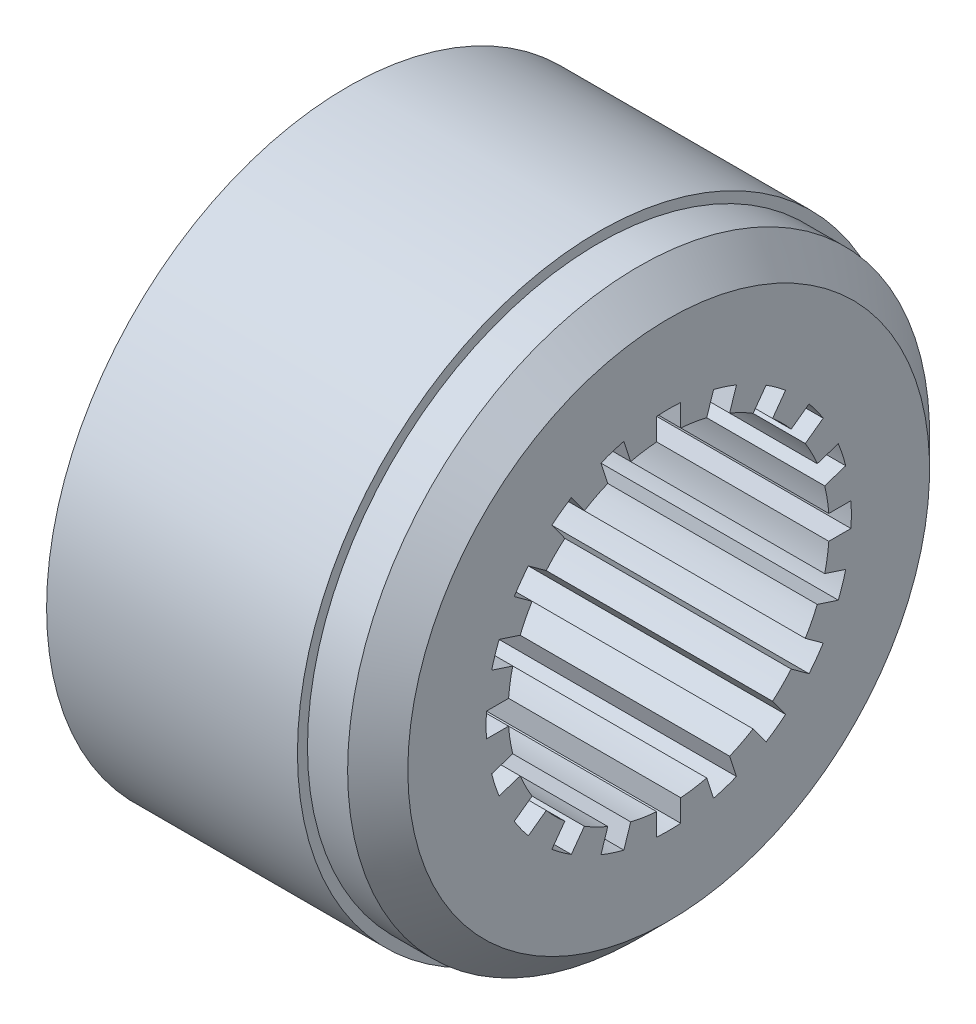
ISO-10303-21;
HEADER;
FILE_DESCRIPTION(('STEP AP214'),'2;1');
FILE_NAME('part.step','',(''),(''),'','','');
FILE_SCHEMA(('AUTOMOTIVE_DESIGN { 1 0 10303 214 1 1 1 1 }'));
ENDSEC;
DATA;
#1=APPLICATION_CONTEXT('core data for automotive mechanical design processes');
#2=APPLICATION_PROTOCOL_DEFINITION('international standard','automotive_design',2000,#1);
#3=PRODUCT_CONTEXT('',#1,'mechanical');
#4=PRODUCT('Part','Part','',(#3));
#5=PRODUCT_RELATED_PRODUCT_CATEGORY('part','',(#4));
#6=PRODUCT_DEFINITION_FORMATION('','',#4);
#7=PRODUCT_DEFINITION_CONTEXT('part definition',#1,'design');
#8=PRODUCT_DEFINITION('design','',#6,#7);
#9=PRODUCT_DEFINITION_SHAPE('','',#8);
#10=(LENGTH_UNIT() NAMED_UNIT(*) SI_UNIT(.MILLI.,.METRE.));
#11=(NAMED_UNIT(*) PLANE_ANGLE_UNIT() SI_UNIT($,.RADIAN.));
#12=(NAMED_UNIT(*) SI_UNIT($,.STERADIAN.) SOLID_ANGLE_UNIT());
#13=UNCERTAINTY_MEASURE_WITH_UNIT(LENGTH_MEASURE(1.E-05),#10,'distance_accuracy_value','');
#14=(GEOMETRIC_REPRESENTATION_CONTEXT(3) GLOBAL_UNCERTAINTY_ASSIGNED_CONTEXT((#13)) GLOBAL_UNIT_ASSIGNED_CONTEXT((#10,
#11,#12)) REPRESENTATION_CONTEXT('',''));
#15=CARTESIAN_POINT('',(0.,0.,0.));
#16=DIRECTION('',(0.,0.,1.));
#17=DIRECTION('',(1.,0.,0.));
#18=AXIS2_PLACEMENT_3D('',#15,#16,#17);
#19=CARTESIAN_POINT('',(3.5,75.,0.));
#20=DIRECTION('',(1.,0.,0.));
#21=DIRECTION('',(0.,0.,-1.));
#22=AXIS2_PLACEMENT_3D('',#19,#20,#21);
#23=PLANE('',#22);
#24=CARTESIAN_POINT('',(3.5,-31.2500000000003,-54.1265877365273));
#25=DIRECTION('',(-1.,0.,0.));
#26=DIRECTION('',(0.,0.,1.));
#27=AXIS2_PLACEMENT_3D('',#24,#25,#26);
#28=CIRCLE('',#27,8.24999999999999);
#29=CARTESIAN_POINT('',(3.5,-31.2500000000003,-45.8765877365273));
#30=VERTEX_POINT('',#29);
#31=EDGE_CURVE('E546',#30,#30,#28,.T.);
#32=ORIENTED_EDGE('',*,*,#31,.F.);
#33=EDGE_LOOP('',(#32));
#34=FACE_BOUND('',#33,.T.);
#35=CARTESIAN_POINT('',(3.5,62.5,0.));
#36=DIRECTION('',(-1.,0.,0.));
#37=DIRECTION('',(0.,0.,1.));
#38=AXIS2_PLACEMENT_3D('',#35,#36,#37);
#39=CIRCLE('',#38,8.24999999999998);
#40=CARTESIAN_POINT('',(3.5,62.5,8.24999999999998));
#41=VERTEX_POINT('',#40);
#42=EDGE_CURVE('E1033',#41,#41,#39,.T.);
#43=ORIENTED_EDGE('',*,*,#42,.F.);
#44=EDGE_LOOP('',(#43));
#45=FACE_BOUND('',#44,.T.);
#46=CARTESIAN_POINT('',(3.5,0.,0.));
#47=DIRECTION('',(-1.,0.,0.));
#48=DIRECTION('',(0.,0.,1.));
#49=AXIS2_PLACEMENT_3D('',#46,#47,#48);
#50=CIRCLE('',#49,45.5);
#51=CARTESIAN_POINT('',(3.50000000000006,44.1059594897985,-11.1765082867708));
#52=VERTEX_POINT('',#51);
#53=CARTESIAN_POINT('',(3.5,42.2518575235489,-16.8828473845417));
#54=VERTEX_POINT('',#53);
#55=EDGE_CURVE('E559',#52,#54,#50,.T.);
#56=ORIENTED_EDGE('',*,*,#55,.F.);
#57=DIRECTION('',(0.,0.951056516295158,-0.309016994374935));
#58=VECTOR('',#57,1.);
#59=CARTESIAN_POINT('',(3.50000000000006,44.1059594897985,-11.1765082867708));
#60=LINE('',#59,#58);
#61=CARTESIAN_POINT('',(3.50000000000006,38.8621668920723,-9.4726967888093));
#62=VERTEX_POINT('',#61);
#63=EDGE_CURVE('E557',#62,#52,#60,.T.);
#64=ORIENTED_EDGE('',*,*,#63,.F.);
#65=CARTESIAN_POINT('',(3.5,0.,0.));
#66=DIRECTION('',(-1.,0.,0.));
#67=DIRECTION('',(0.,0.,1.));
#68=AXIS2_PLACEMENT_3D('',#65,#66,#67);
#69=CIRCLE('',#68,40.);
#70=CARTESIAN_POINT('',(3.5,39.8873413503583,-3.));
#71=VERTEX_POINT('',#70);
#72=EDGE_CURVE('E1060',#71,#62,#69,.T.);
#73=ORIENTED_EDGE('',*,*,#72,.F.);
#74=DIRECTION('',(0.,-1.,0.));
#75=VECTOR('',#74,1.);
#76=CARTESIAN_POINT('',(3.5,45.4009911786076,-3.));
#77=LINE('',#76,#75);
#78=CARTESIAN_POINT('',(3.5,45.4009911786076,-3.));
#79=VERTEX_POINT('',#78);
#80=EDGE_CURVE('E1014',#79,#71,#77,.T.);
#81=ORIENTED_EDGE('',*,*,#80,.F.);
#82=CARTESIAN_POINT('',(3.5,0.,0.));
#83=DIRECTION('',(-1.,0.,0.));
#84=DIRECTION('',(0.,0.,1.));
#85=AXIS2_PLACEMENT_3D('',#82,#83,#84);
#86=CIRCLE('',#85,45.5);
#87=CARTESIAN_POINT('',(3.5,45.4009911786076,3.));
#88=VERTEX_POINT('',#87);
#89=EDGE_CURVE('E1011',#88,#79,#86,.T.);
#90=ORIENTED_EDGE('',*,*,#89,.F.);
#91=DIRECTION('',(0.,1.,0.));
#92=VECTOR('',#91,1.);
#93=CARTESIAN_POINT('',(3.5,45.4009911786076,3.));
#94=LINE('',#93,#92);
#95=CARTESIAN_POINT('',(3.5,39.8873413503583,3.));
#96=VERTEX_POINT('',#95);
#97=EDGE_CURVE('E1009',#96,#88,#94,.T.);
#98=ORIENTED_EDGE('',*,*,#97,.F.);
#99=CARTESIAN_POINT('',(3.49999999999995,38.8621668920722,9.47269678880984));
#100=VERTEX_POINT('',#99);
#101=EDGE_CURVE('E1058',#100,#96,#69,.T.);
#102=ORIENTED_EDGE('',*,*,#101,.F.);
#103=DIRECTION('',(0.,-0.951056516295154,-0.309016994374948));
#104=VECTOR('',#103,1.);
#105=CARTESIAN_POINT('',(3.5,44.1059594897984,11.1765082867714));
#106=LINE('',#105,#104);
#107=CARTESIAN_POINT('',(3.5,44.1059594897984,11.1765082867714));
#108=VERTEX_POINT('',#107);
#109=EDGE_CURVE('E990',#108,#100,#106,.T.);
#110=ORIENTED_EDGE('',*,*,#109,.F.);
#111=CARTESIAN_POINT('',(3.5,0.,0.));
#112=DIRECTION('',(-1.,0.,0.));
#113=DIRECTION('',(0.,0.,1.));
#114=AXIS2_PLACEMENT_3D('',#111,#112,#113);
#115=CIRCLE('',#114,45.5);
#116=CARTESIAN_POINT('',(3.49999999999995,42.2518575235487,16.8828473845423));
#117=VERTEX_POINT('',#116);
#118=EDGE_CURVE('E987',#117,#108,#115,.T.);
#119=ORIENTED_EDGE('',*,*,#118,.F.);
#120=DIRECTION('',(0.,0.951056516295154,0.309016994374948));
#121=VECTOR('',#120,1.);
#122=CARTESIAN_POINT('',(3.49999999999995,42.2518575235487,16.8828473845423));
#123=LINE('',#122,#121);
#124=CARTESIAN_POINT('',(3.49999999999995,37.0080649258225,15.1790358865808));
#125=VERTEX_POINT('',#124);
#126=EDGE_CURVE('E985',#125,#117,#123,.T.);
#127=ORIENTED_EDGE('',*,*,#126,.F.);
#128=CARTESIAN_POINT('',(3.49999999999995,34.0328927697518,21.0181400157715));
#129=VERTEX_POINT('',#128);
#130=EDGE_CURVE('E1194',#129,#125,#69,.T.);
#131=ORIENTED_EDGE('',*,*,#130,.F.);
#132=DIRECTION('',(0.,-0.809016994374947,-0.587785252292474));
#133=VECTOR('',#132,1.);
#134=CARTESIAN_POINT('',(3.49999999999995,38.493529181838,24.2589820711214));
#135=LINE('',#134,#133);
#136=CARTESIAN_POINT('',(3.49999999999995,38.493529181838,24.2589820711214));
#137=VERTEX_POINT('',#136);
#138=EDGE_CURVE('E966',#137,#129,#135,.T.);
#139=ORIENTED_EDGE('',*,*,#138,.F.);
#140=CARTESIAN_POINT('',(3.5,0.,0.));
#141=DIRECTION('',(-1.,0.,0.));
#142=DIRECTION('',(0.,0.,1.));
#143=AXIS2_PLACEMENT_3D('',#140,#141,#142);
#144=CIRCLE('',#143,45.5);
#145=CARTESIAN_POINT('',(3.5,34.9668176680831,29.1130840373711));
#146=VERTEX_POINT('',#145);
#147=EDGE_CURVE('E963',#146,#137,#144,.T.);
#148=ORIENTED_EDGE('',*,*,#147,.F.);
#149=DIRECTION('',(0.,0.809016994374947,0.587785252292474));
#150=VECTOR('',#149,1.);
#151=CARTESIAN_POINT('',(3.5,34.9668176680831,29.1130840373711));
#152=LINE('',#151,#150);
#153=CARTESIAN_POINT('',(3.49999999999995,30.506181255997,25.8722419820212));
#154=VERTEX_POINT('',#153);
#155=EDGE_CURVE('E961',#154,#146,#152,.T.);
#156=ORIENTED_EDGE('',*,*,#155,.F.);
#157=CARTESIAN_POINT('',(3.5,25.8722419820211,30.506181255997));
#158=VERTEX_POINT('',#157);
#159=EDGE_CURVE('E1190',#158,#154,#69,.T.);
#160=ORIENTED_EDGE('',*,*,#159,.F.);
#161=DIRECTION('',(0.,-0.587785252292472,-0.809016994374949));
#162=VECTOR('',#161,1.);
#163=CARTESIAN_POINT('',(3.5,29.113084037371,34.9668176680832));
#164=LINE('',#163,#162);
#165=CARTESIAN_POINT('',(3.5,29.113084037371,34.9668176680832));
#166=VERTEX_POINT('',#165);
#167=EDGE_CURVE('E942',#166,#158,#164,.T.);
#168=ORIENTED_EDGE('',*,*,#167,.F.);
#169=CARTESIAN_POINT('',(3.5,0.,0.));
#170=DIRECTION('',(-1.,0.,0.));
#171=DIRECTION('',(0.,0.,1.));
#172=AXIS2_PLACEMENT_3D('',#169,#170,#171);
#173=CIRCLE('',#172,45.5);
#174=CARTESIAN_POINT('',(3.50000000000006,24.2589820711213,38.4935291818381));
#175=VERTEX_POINT('',#174);
#176=EDGE_CURVE('E939',#175,#166,#173,.T.);
#177=ORIENTED_EDGE('',*,*,#176,.F.);
#178=DIRECTION('',(0.,0.587785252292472,0.809016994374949));
#179=VECTOR('',#178,1.);
#180=CARTESIAN_POINT('',(3.50000000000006,24.2589820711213,38.4935291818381));
#181=LINE('',#180,#179);
#182=CARTESIAN_POINT('',(3.5,21.0181400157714,34.0328927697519));
#183=VERTEX_POINT('',#182);
#184=EDGE_CURVE('E937',#183,#175,#181,.T.);
#185=ORIENTED_EDGE('',*,*,#184,.F.);
#186=CARTESIAN_POINT('',(3.50000000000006,15.1790358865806,37.0080649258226));
#187=VERTEX_POINT('',#186);
#188=EDGE_CURVE('E1186',#187,#183,#69,.T.);
#189=ORIENTED_EDGE('',*,*,#188,.F.);
#190=DIRECTION('',(0.,-0.309016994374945,-0.951056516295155));
#191=VECTOR('',#190,1.);
#192=CARTESIAN_POINT('',(3.50000000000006,16.8828473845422,42.2518575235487));
#193=LINE('',#192,#191);
#194=CARTESIAN_POINT('',(3.50000000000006,16.8828473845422,42.2518575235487));
#195=VERTEX_POINT('',#194);
#196=EDGE_CURVE('E918',#195,#187,#193,.T.);
#197=ORIENTED_EDGE('',*,*,#196,.F.);
#198=CARTESIAN_POINT('',(3.5,0.,0.));
#199=DIRECTION('',(-1.,0.,0.));
#200=DIRECTION('',(0.,0.,1.));
#201=AXIS2_PLACEMENT_3D('',#198,#199,#200);
#202=CIRCLE('',#201,45.5);
#203=CARTESIAN_POINT('',(3.50000000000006,11.1765082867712,44.1059594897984));
#204=VERTEX_POINT('',#203);
#205=EDGE_CURVE('E915',#204,#195,#202,.T.);
#206=ORIENTED_EDGE('',*,*,#205,.F.);
#207=DIRECTION('',(0.,0.309016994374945,0.951056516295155));
#208=VECTOR('',#207,1.);
#209=CARTESIAN_POINT('',(3.50000000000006,11.1765082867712,44.1059594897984));
#210=LINE('',#209,#208);
#211=CARTESIAN_POINT('',(3.50000000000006,9.4726967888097,38.8621668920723));
#212=VERTEX_POINT('',#211);
#213=EDGE_CURVE('E913',#212,#204,#210,.T.);
#214=ORIENTED_EDGE('',*,*,#213,.F.);
#215=CARTESIAN_POINT('',(3.5,2.99999999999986,39.8873413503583));
#216=VERTEX_POINT('',#215);
#217=EDGE_CURVE('E1182',#216,#212,#69,.T.);
#218=ORIENTED_EDGE('',*,*,#217,.F.);
#219=DIRECTION('',(0.,0.,-1.));
#220=VECTOR('',#219,1.);
#221=CARTESIAN_POINT('',(3.5,2.99999999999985,45.4009911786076));
#222=LINE('',#221,#220);
#223=CARTESIAN_POINT('',(3.5,2.99999999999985,45.4009911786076));
#224=VERTEX_POINT('',#223);
#225=EDGE_CURVE('E894',#224,#216,#222,.T.);
#226=ORIENTED_EDGE('',*,*,#225,.F.);
#227=CARTESIAN_POINT('',(3.5,0.,0.));
#228=DIRECTION('',(-1.,0.,0.));
#229=DIRECTION('',(0.,0.,1.));
#230=AXIS2_PLACEMENT_3D('',#227,#228,#229);
#231=CIRCLE('',#230,45.5);
#232=CARTESIAN_POINT('',(3.5,-3.00000000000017,45.4009911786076));
#233=VERTEX_POINT('',#232);
#234=EDGE_CURVE('E891',#233,#224,#231,.T.);
#235=ORIENTED_EDGE('',*,*,#234,.F.);
#236=DIRECTION('',(0.,0.,1.));
#237=VECTOR('',#236,1.);
#238=CARTESIAN_POINT('',(3.5,-3.00000000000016,45.4009911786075));
#239=LINE('',#238,#237);
#240=CARTESIAN_POINT('',(3.5,-3.00000000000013,39.8873413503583));
#241=VERTEX_POINT('',#240);
#242=EDGE_CURVE('E889',#241,#233,#239,.T.);
#243=ORIENTED_EDGE('',*,*,#242,.F.);
#244=CARTESIAN_POINT('',(3.5,-9.47269678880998,38.8621668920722));
#245=VERTEX_POINT('',#244);
#246=EDGE_CURVE('E1178',#245,#241,#69,.T.);
#247=ORIENTED_EDGE('',*,*,#246,.F.);
#248=DIRECTION('',(0.,0.309016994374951,-0.951056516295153));
#249=VECTOR('',#248,1.);
#250=CARTESIAN_POINT('',(3.5,-11.1765082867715,44.1059594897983));
#251=LINE('',#250,#249);
#252=CARTESIAN_POINT('',(3.5,-11.1765082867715,44.1059594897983));
#253=VERTEX_POINT('',#252);
#254=EDGE_CURVE('E870',#253,#245,#251,.T.);
#255=ORIENTED_EDGE('',*,*,#254,.F.);
#256=CARTESIAN_POINT('',(3.5,0.,0.));
#257=DIRECTION('',(-1.,0.,0.));
#258=DIRECTION('',(0.,0.,1.));
#259=AXIS2_PLACEMENT_3D('',#256,#257,#258);
#260=CIRCLE('',#259,45.5);
#261=CARTESIAN_POINT('',(3.5,-16.8828473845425,42.2518575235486));
#262=VERTEX_POINT('',#261);
#263=EDGE_CURVE('E867',#262,#253,#260,.T.);
#264=ORIENTED_EDGE('',*,*,#263,.F.);
#265=DIRECTION('',(0.,-0.309016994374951,0.951056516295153));
#266=VECTOR('',#265,1.);
#267=CARTESIAN_POINT('',(3.5,-16.8828473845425,42.2518575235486));
#268=LINE('',#267,#266);
#269=CARTESIAN_POINT('',(3.5,-15.1790358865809,37.0080649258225));
#270=VERTEX_POINT('',#269);
#271=EDGE_CURVE('E865',#270,#262,#268,.T.);
#272=ORIENTED_EDGE('',*,*,#271,.F.);
#273=CARTESIAN_POINT('',(3.50000000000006,-21.0181400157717,34.0328927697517));
#274=VERTEX_POINT('',#273);
#275=EDGE_CURVE('E1174',#274,#270,#69,.T.);
#276=ORIENTED_EDGE('',*,*,#275,.F.);
#277=DIRECTION('',(0.,0.587785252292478,-0.809016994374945));
#278=VECTOR('',#277,1.);
#279=CARTESIAN_POINT('',(3.50000000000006,-24.2589820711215,38.4935291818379));
#280=LINE('',#279,#278);
#281=CARTESIAN_POINT('',(3.50000000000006,-24.2589820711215,38.4935291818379));
#282=VERTEX_POINT('',#281);
#283=EDGE_CURVE('E846',#282,#274,#280,.T.);
#284=ORIENTED_EDGE('',*,*,#283,.F.);
#285=CARTESIAN_POINT('',(3.5,0.,0.));
#286=DIRECTION('',(-1.,0.,0.));
#287=DIRECTION('',(0.,0.,1.));
#288=AXIS2_PLACEMENT_3D('',#285,#286,#287);
#289=CIRCLE('',#288,45.5);
#290=CARTESIAN_POINT('',(3.50000000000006,-29.1130840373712,34.966817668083));
#291=VERTEX_POINT('',#290);
#292=EDGE_CURVE('E843',#291,#282,#289,.T.);
#293=ORIENTED_EDGE('',*,*,#292,.F.);
#294=DIRECTION('',(0.,-0.587785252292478,0.809016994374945));
#295=VECTOR('',#294,1.);
#296=CARTESIAN_POINT('',(3.50000000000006,-29.1130840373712,34.966817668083));
#297=LINE('',#296,#295);
#298=CARTESIAN_POINT('',(3.50000000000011,-25.8722419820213,30.5061812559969));
#299=VERTEX_POINT('',#298);
#300=EDGE_CURVE('E841',#299,#291,#297,.T.);
#301=ORIENTED_EDGE('',*,*,#300,.F.);
#302=CARTESIAN_POINT('',(3.50000000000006,-30.5061812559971,25.872241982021));
#303=VERTEX_POINT('',#302);
#304=EDGE_CURVE('E1170',#303,#299,#69,.T.);
#305=ORIENTED_EDGE('',*,*,#304,.F.);
#306=DIRECTION('',(0.,0.809016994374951,-0.587785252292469));
#307=VECTOR('',#306,1.);
#308=CARTESIAN_POINT('',(3.5,-34.9668176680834,29.1130840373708));
#309=LINE('',#308,#307);
#310=CARTESIAN_POINT('',(3.5,-34.9668176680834,29.1130840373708));
#311=VERTEX_POINT('',#310);
#312=EDGE_CURVE('E822',#311,#303,#309,.T.);
#313=ORIENTED_EDGE('',*,*,#312,.F.);
#314=CARTESIAN_POINT('',(3.5,0.,0.));
#315=DIRECTION('',(-1.,0.,0.));
#316=DIRECTION('',(0.,0.,1.));
#317=AXIS2_PLACEMENT_3D('',#314,#315,#316);
#318=CIRCLE('',#317,45.5);
#319=CARTESIAN_POINT('',(3.49999999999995,-38.4935291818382,24.2589820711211));
#320=VERTEX_POINT('',#319);
#321=EDGE_CURVE('E819',#320,#311,#318,.T.);
#322=ORIENTED_EDGE('',*,*,#321,.F.);
#323=DIRECTION('',(0.,-0.809016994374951,0.587785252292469));
#324=VECTOR('',#323,1.);
#325=CARTESIAN_POINT('',(3.49999999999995,-38.4935291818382,24.2589820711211));
#326=LINE('',#325,#324);
#327=CARTESIAN_POINT('',(3.5,-34.0328927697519,21.0181400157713));
#328=VERTEX_POINT('',#327);
#329=EDGE_CURVE('E817',#328,#320,#326,.T.);
#330=ORIENTED_EDGE('',*,*,#329,.F.);
#331=CARTESIAN_POINT('',(3.49999999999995,-37.0080649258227,15.1790358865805));
#332=VERTEX_POINT('',#331);
#333=EDGE_CURVE('E1166',#332,#328,#69,.T.);
#334=ORIENTED_EDGE('',*,*,#333,.F.);
#335=DIRECTION('',(0.,0.951056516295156,-0.309016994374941));
#336=VECTOR('',#335,1.);
#337=CARTESIAN_POINT('',(3.5,-42.2518575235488,16.882847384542));
#338=LINE('',#337,#336);
#339=CARTESIAN_POINT('',(3.5,-42.2518575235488,16.882847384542));
#340=VERTEX_POINT('',#339);
#341=EDGE_CURVE('E798',#340,#332,#338,.T.);
#342=ORIENTED_EDGE('',*,*,#341,.F.);
#343=CARTESIAN_POINT('',(3.5,0.,0.));
#344=DIRECTION('',(-1.,0.,0.));
#345=DIRECTION('',(0.,0.,1.));
#346=AXIS2_PLACEMENT_3D('',#343,#344,#345);
#347=CIRCLE('',#346,45.5);
#348=CARTESIAN_POINT('',(3.49999999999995,-44.1059594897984,11.1765082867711));
#349=VERTEX_POINT('',#348);
#350=EDGE_CURVE('E795',#349,#340,#347,.T.);
#351=ORIENTED_EDGE('',*,*,#350,.F.);
#352=DIRECTION('',(0.,-0.951056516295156,0.309016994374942));
#353=VECTOR('',#352,1.);
#354=CARTESIAN_POINT('',(3.49999999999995,-44.1059594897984,11.1765082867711));
#355=LINE('',#354,#353);
#356=CARTESIAN_POINT('',(3.49999999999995,-38.8621668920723,9.47269678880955));
#357=VERTEX_POINT('',#356);
#358=EDGE_CURVE('E793',#357,#349,#355,.T.);
#359=ORIENTED_EDGE('',*,*,#358,.F.);
#360=CARTESIAN_POINT('',(3.5,-39.8873413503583,2.99999999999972));
#361=VERTEX_POINT('',#360);
#362=EDGE_CURVE('E1162',#361,#357,#69,.T.);
#363=ORIENTED_EDGE('',*,*,#362,.F.);
#364=DIRECTION('',(0.,1.,0.));
#365=VECTOR('',#364,1.);
#366=CARTESIAN_POINT('',(3.5,-45.4009911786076,2.99999999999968));
#367=LINE('',#366,#365);
#368=CARTESIAN_POINT('',(3.5,-45.4009911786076,2.99999999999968));
#369=VERTEX_POINT('',#368);
#370=EDGE_CURVE('E774',#369,#361,#367,.T.);
#371=ORIENTED_EDGE('',*,*,#370,.F.);
#372=CARTESIAN_POINT('',(3.5,0.,0.));
#373=DIRECTION('',(-1.,0.,0.));
#374=DIRECTION('',(0.,0.,1.));
#375=AXIS2_PLACEMENT_3D('',#372,#373,#374);
#376=CIRCLE('',#375,45.5);
#377=CARTESIAN_POINT('',(3.5,-45.4009911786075,-3.00000000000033));
#378=VERTEX_POINT('',#377);
#379=EDGE_CURVE('E771',#378,#369,#376,.T.);
#380=ORIENTED_EDGE('',*,*,#379,.F.);
#381=DIRECTION('',(0.,-1.,0.));
#382=VECTOR('',#381,1.);
#383=CARTESIAN_POINT('',(3.5,-45.4009911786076,-3.00000000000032));
#384=LINE('',#383,#382);
#385=CARTESIAN_POINT('',(3.5,-39.8873413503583,-3.00000000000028));
#386=VERTEX_POINT('',#385);
#387=EDGE_CURVE('E769',#386,#378,#384,.T.);
#388=ORIENTED_EDGE('',*,*,#387,.F.);
#389=CARTESIAN_POINT('',(3.5,-38.8621668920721,-9.47269678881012));
#390=VERTEX_POINT('',#389);
#391=EDGE_CURVE('E1158',#390,#386,#69,.T.);
#392=ORIENTED_EDGE('',*,*,#391,.F.);
#393=DIRECTION('',(0.,0.951056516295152,0.309016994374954));
#394=VECTOR('',#393,1.);
#395=CARTESIAN_POINT('',(3.5,-44.1059594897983,-11.1765082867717));
#396=LINE('',#395,#394);
#397=CARTESIAN_POINT('',(3.5,-44.1059594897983,-11.1765082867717));
#398=VERTEX_POINT('',#397);
#399=EDGE_CURVE('E750',#398,#390,#396,.T.);
#400=ORIENTED_EDGE('',*,*,#399,.F.);
#401=CARTESIAN_POINT('',(3.5,0.,0.));
#402=DIRECTION('',(-1.,0.,0.));
#403=DIRECTION('',(0.,0.,1.));
#404=AXIS2_PLACEMENT_3D('',#401,#402,#403);
#405=CIRCLE('',#404,45.5);
#406=CARTESIAN_POINT('',(3.5,-42.2518575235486,-16.8828473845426));
#407=VERTEX_POINT('',#406);
#408=EDGE_CURVE('E747',#407,#398,#405,.T.);
#409=ORIENTED_EDGE('',*,*,#408,.F.);
#410=DIRECTION('',(0.,-0.951056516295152,-0.309016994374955));
#411=VECTOR('',#410,1.);
#412=CARTESIAN_POINT('',(3.5,-42.2518575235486,-16.8828473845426));
#413=LINE('',#412,#411);
#414=CARTESIAN_POINT('',(3.5,-37.0080649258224,-15.179035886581));
#415=VERTEX_POINT('',#414);
#416=EDGE_CURVE('E745',#415,#407,#413,.T.);
#417=ORIENTED_EDGE('',*,*,#416,.F.);
#418=CARTESIAN_POINT('',(3.5,-34.0328927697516,-21.0181400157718));
#419=VERTEX_POINT('',#418);
#420=EDGE_CURVE('E1154',#419,#415,#69,.T.);
#421=ORIENTED_EDGE('',*,*,#420,.F.);
#422=DIRECTION('',(0.,0.809016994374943,0.58778525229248));
#423=VECTOR('',#422,1.);
#424=CARTESIAN_POINT('',(3.5,-38.4935291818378,-24.2589820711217));
#425=LINE('',#424,#423);
#426=CARTESIAN_POINT('',(3.5,-38.4935291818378,-24.2589820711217));
#427=VERTEX_POINT('',#426);
#428=EDGE_CURVE('E726',#427,#419,#425,.T.);
#429=ORIENTED_EDGE('',*,*,#428,.F.);
#430=CARTESIAN_POINT('',(3.5,0.,0.));
#431=DIRECTION('',(-1.,0.,0.));
#432=DIRECTION('',(0.,0.,1.));
#433=AXIS2_PLACEMENT_3D('',#430,#431,#432);
#434=CIRCLE('',#433,45.5);
#435=CARTESIAN_POINT('',(3.5,-34.9668176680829,-29.1130840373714));
#436=VERTEX_POINT('',#435);
#437=EDGE_CURVE('E723',#436,#427,#434,.T.);
#438=ORIENTED_EDGE('',*,*,#437,.F.);
#439=DIRECTION('',(0.,-0.809016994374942,-0.587785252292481));
#440=VECTOR('',#439,1.);
#441=CARTESIAN_POINT('',(3.5,-34.9668176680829,-29.1130840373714));
#442=LINE('',#441,#440);
#443=CARTESIAN_POINT('',(3.50000000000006,-30.5061812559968,-25.8722419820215));
#444=VERTEX_POINT('',#443);
#445=EDGE_CURVE('E721',#444,#436,#442,.T.);
#446=ORIENTED_EDGE('',*,*,#445,.F.);
#447=CARTESIAN_POINT('',(3.5,-25.8722419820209,-30.5061812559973));
#448=VERTEX_POINT('',#447);
#449=EDGE_CURVE('E1150',#448,#444,#69,.T.);
#450=ORIENTED_EDGE('',*,*,#449,.F.);
#451=DIRECTION('',(0.,0.587785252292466,0.809016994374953));
#452=VECTOR('',#451,1.);
#453=CARTESIAN_POINT('',(3.5,-29.1130840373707,-34.9668176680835));
#454=LINE('',#453,#452);
#455=CARTESIAN_POINT('',(3.5,-29.1130840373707,-34.9668176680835));
#456=VERTEX_POINT('',#455);
#457=EDGE_CURVE('E702',#456,#448,#454,.T.);
#458=ORIENTED_EDGE('',*,*,#457,.F.);
#459=CARTESIAN_POINT('',(3.5,0.,0.));
#460=DIRECTION('',(-1.,0.,0.));
#461=DIRECTION('',(0.,0.,1.));
#462=AXIS2_PLACEMENT_3D('',#459,#460,#461);
#463=CIRCLE('',#462,45.5);
#464=CARTESIAN_POINT('',(3.49999999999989,-24.2589820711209,-38.4935291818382));
#465=VERTEX_POINT('',#464);
#466=EDGE_CURVE('E699',#465,#456,#463,.T.);
#467=ORIENTED_EDGE('',*,*,#466,.F.);
#468=DIRECTION('',(0.,-0.587785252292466,-0.809016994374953));
#469=VECTOR('',#468,1.);
#470=CARTESIAN_POINT('',(3.49999999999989,-24.258982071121,-38.4935291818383));
#471=LINE('',#470,#469);
#472=CARTESIAN_POINT('',(3.49999999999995,-21.0181400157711,-34.032892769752));
#473=VERTEX_POINT('',#472);
#474=EDGE_CURVE('E697',#473,#465,#471,.T.);
#475=ORIENTED_EDGE('',*,*,#474,.F.);
#476=CARTESIAN_POINT('',(3.49999999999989,-15.1790358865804,-37.0080649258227));
#477=VERTEX_POINT('',#476);
#478=EDGE_CURVE('E1146',#477,#473,#69,.T.);
#479=ORIENTED_EDGE('',*,*,#478,.F.);
#480=DIRECTION('',(0.,0.309016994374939,0.951056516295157));
#481=VECTOR('',#480,1.);
#482=CARTESIAN_POINT('',(3.49999999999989,-16.8828473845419,-42.2518575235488));
#483=LINE('',#482,#481);
#484=CARTESIAN_POINT('',(3.49999999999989,-16.8828473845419,-42.2518575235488));
#485=VERTEX_POINT('',#484);
#486=EDGE_CURVE('E678',#485,#477,#483,.T.);
#487=ORIENTED_EDGE('',*,*,#486,.F.);
#488=CARTESIAN_POINT('',(3.5,0.,0.));
#489=DIRECTION('',(-1.,0.,0.));
#490=DIRECTION('',(0.,0.,1.));
#491=AXIS2_PLACEMENT_3D('',#488,#489,#490);
#492=CIRCLE('',#491,45.5);
#493=CARTESIAN_POINT('',(3.49999999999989,-11.1765082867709,-44.1059594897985));
#494=VERTEX_POINT('',#493);
#495=EDGE_CURVE('E675',#494,#485,#492,.T.);
#496=ORIENTED_EDGE('',*,*,#495,.F.);
#497=DIRECTION('',(0.,-0.309016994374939,-0.951056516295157));
#498=VECTOR('',#497,1.);
#499=CARTESIAN_POINT('',(3.49999999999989,-11.1765082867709,-44.1059594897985));
#500=LINE('',#499,#498);
#501=CARTESIAN_POINT('',(3.49999999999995,-9.47269678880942,-38.8621668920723));
#502=VERTEX_POINT('',#501);
#503=EDGE_CURVE('E673',#502,#494,#500,.T.);
#504=ORIENTED_EDGE('',*,*,#503,.F.);
#505=CARTESIAN_POINT('',(3.49999999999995,-2.99999999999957,-39.8873413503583));
#506=VERTEX_POINT('',#505);
#507=EDGE_CURVE('E1142',#506,#502,#69,.T.);
#508=ORIENTED_EDGE('',*,*,#507,.F.);
#509=DIRECTION('',(0.,0.,1.));
#510=VECTOR('',#509,1.);
#511=CARTESIAN_POINT('',(3.5,-2.99999999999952,-45.4009911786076));
#512=LINE('',#511,#510);
#513=CARTESIAN_POINT('',(3.5,-2.99999999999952,-45.4009911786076));
#514=VERTEX_POINT('',#513);
#515=EDGE_CURVE('E654',#514,#506,#512,.T.);
#516=ORIENTED_EDGE('',*,*,#515,.F.);
#517=CARTESIAN_POINT('',(3.5,0.,0.));
#518=DIRECTION('',(-1.,0.,0.));
#519=DIRECTION('',(0.,0.,1.));
#520=AXIS2_PLACEMENT_3D('',#517,#518,#519);
#521=CIRCLE('',#520,45.5);
#522=CARTESIAN_POINT('',(3.5,3.00000000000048,-45.4009911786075));
#523=VERTEX_POINT('',#522);
#524=EDGE_CURVE('E651',#523,#514,#521,.T.);
#525=ORIENTED_EDGE('',*,*,#524,.F.);
#526=DIRECTION('',(0.,0.,-1.));
#527=VECTOR('',#526,1.);
#528=CARTESIAN_POINT('',(3.5,3.00000000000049,-45.4009911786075));
#529=LINE('',#528,#527);
#530=CARTESIAN_POINT('',(3.5,3.00000000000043,-39.8873413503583));
#531=VERTEX_POINT('',#530);
#532=EDGE_CURVE('E649',#531,#523,#529,.T.);
#533=ORIENTED_EDGE('',*,*,#532,.F.);
#534=CARTESIAN_POINT('',(3.5,9.47269678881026,-38.8621668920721));
#535=VERTEX_POINT('',#534);
#536=EDGE_CURVE('E1138',#535,#531,#69,.T.);
#537=ORIENTED_EDGE('',*,*,#536,.F.);
#538=DIRECTION('',(0.,-0.309016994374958,0.951056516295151));
#539=VECTOR('',#538,1.);
#540=CARTESIAN_POINT('',(3.5,11.1765082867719,-44.1059594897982));
#541=LINE('',#540,#539);
#542=CARTESIAN_POINT('',(3.5,11.1765082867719,-44.1059594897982));
#543=VERTEX_POINT('',#542);
#544=EDGE_CURVE('E630',#543,#535,#541,.T.);
#545=ORIENTED_EDGE('',*,*,#544,.F.);
#546=CARTESIAN_POINT('',(3.5,0.,0.));
#547=DIRECTION('',(-1.,0.,0.));
#548=DIRECTION('',(0.,0.,1.));
#549=AXIS2_PLACEMENT_3D('',#546,#547,#548);
#550=CIRCLE('',#549,45.5);
#551=CARTESIAN_POINT('',(3.5,16.8828473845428,-42.2518575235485));
#552=VERTEX_POINT('',#551);
#553=EDGE_CURVE('E627',#552,#543,#550,.T.);
#554=ORIENTED_EDGE('',*,*,#553,.F.);
#555=DIRECTION('',(0.,0.309016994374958,-0.951056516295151));
#556=VECTOR('',#555,1.);
#557=CARTESIAN_POINT('',(3.5,16.8828473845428,-42.2518575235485));
#558=LINE('',#557,#556);
#559=CARTESIAN_POINT('',(3.5,15.1790358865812,-37.0080649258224));
#560=VERTEX_POINT('',#559);
#561=EDGE_CURVE('E625',#560,#552,#558,.T.);
#562=ORIENTED_EDGE('',*,*,#561,.F.);
#563=CARTESIAN_POINT('',(3.49999999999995,21.0181400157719,-34.0328927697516));
#564=VERTEX_POINT('',#563);
#565=EDGE_CURVE('E1134',#564,#560,#69,.T.);
#566=ORIENTED_EDGE('',*,*,#565,.F.);
#567=DIRECTION('',(0.,-0.587785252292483,0.809016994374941));
#568=VECTOR('',#567,1.);
#569=CARTESIAN_POINT('',(3.49999999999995,24.2589820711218,-38.4935291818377));
#570=LINE('',#569,#568);
#571=CARTESIAN_POINT('',(3.49999999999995,24.2589820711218,-38.4935291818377));
#572=VERTEX_POINT('',#571);
#573=EDGE_CURVE('E606',#572,#564,#570,.T.);
#574=ORIENTED_EDGE('',*,*,#573,.F.);
#575=CARTESIAN_POINT('',(3.5,0.,0.));
#576=DIRECTION('',(-1.,0.,0.));
#577=DIRECTION('',(0.,0.,1.));
#578=AXIS2_PLACEMENT_3D('',#575,#576,#577);
#579=CIRCLE('',#578,45.5);
#580=CARTESIAN_POINT('',(3.49999999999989,29.1130840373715,-34.9668176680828));
#581=VERTEX_POINT('',#580);
#582=EDGE_CURVE('E603',#581,#572,#579,.T.);
#583=ORIENTED_EDGE('',*,*,#582,.F.);
#584=DIRECTION('',(0.,0.587785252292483,-0.809016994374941));
#585=VECTOR('',#584,1.);
#586=CARTESIAN_POINT('',(3.49999999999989,29.1130840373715,-34.9668176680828));
#587=LINE('',#586,#585);
#588=CARTESIAN_POINT('',(3.49999999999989,25.8722419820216,-30.5061812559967));
#589=VERTEX_POINT('',#588);
#590=EDGE_CURVE('E601',#589,#581,#587,.T.);
#591=ORIENTED_EDGE('',*,*,#590,.F.);
#592=CARTESIAN_POINT('',(3.49999999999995,30.5061812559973,-25.8722419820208));
#593=VERTEX_POINT('',#592);
#594=EDGE_CURVE('E1133',#593,#589,#69,.T.);
#595=ORIENTED_EDGE('',*,*,#594,.F.);
#596=DIRECTION('',(0.,-0.809016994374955,0.587785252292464));
#597=VECTOR('',#596,1.);
#598=CARTESIAN_POINT('',(3.49999999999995,34.9668176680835,-29.1130840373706));
#599=LINE('',#598,#597);
#600=CARTESIAN_POINT('',(3.49999999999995,34.9668176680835,-29.1130840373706));
#601=VERTEX_POINT('',#600);
#602=EDGE_CURVE('E584',#601,#593,#599,.T.);
#603=ORIENTED_EDGE('',*,*,#602,.F.);
#604=CARTESIAN_POINT('',(3.5,0.,0.));
#605=DIRECTION('',(-1.,0.,0.));
#606=DIRECTION('',(0.,0.,1.));
#607=AXIS2_PLACEMENT_3D('',#604,#605,#606);
#608=CIRCLE('',#607,45.5);
#609=CARTESIAN_POINT('',(3.5,38.4935291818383,-24.2589820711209));
#610=VERTEX_POINT('',#609);
#611=EDGE_CURVE('E581',#610,#601,#608,.T.);
#612=ORIENTED_EDGE('',*,*,#611,.F.);
#613=DIRECTION('',(0.,0.809016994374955,-0.587785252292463));
#614=VECTOR('',#613,1.);
#615=CARTESIAN_POINT('',(3.5,38.4935291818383,-24.2589820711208));
#616=LINE('',#615,#614);
#617=CARTESIAN_POINT('',(3.5,34.0328927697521,-21.018140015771));
#618=VERTEX_POINT('',#617);
#619=EDGE_CURVE('E579',#618,#610,#616,.T.);
#620=ORIENTED_EDGE('',*,*,#619,.F.);
#621=CARTESIAN_POINT('',(3.50000000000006,37.0080649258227,-15.1790358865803));
#622=VERTEX_POINT('',#621);
#623=EDGE_CURVE('E1064',#622,#618,#69,.T.);
#624=ORIENTED_EDGE('',*,*,#623,.F.);
#625=DIRECTION('',(0.,-0.951056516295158,0.309016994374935));
#626=VECTOR('',#625,1.);
#627=CARTESIAN_POINT('',(3.5,42.2518575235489,-16.8828473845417));
#628=LINE('',#627,#626);
#629=EDGE_CURVE('E562',#54,#622,#628,.T.);
#630=ORIENTED_EDGE('',*,*,#629,.F.);
#631=EDGE_LOOP('',(#56,#64,#73,#81,#90,#98,#102,#110,#119,#127,#131,#139,#148,#156,#160,#168,
#177,#185,#189,#197,#206,#214,#218,#226,#235,#243,#247,#255,#264,#272,#276,#284,#293,#301,#305,
#313,#322,#330,#334,#342,#351,#359,#363,#371,#380,#388,#392,#400,#409,#417,#421,#429,#438,#446,
#450,#458,#467,#475,#479,#487,#496,#504,#508,#516,#525,#533,#537,#545,#554,#562,#566,#574,#583,
#591,#595,#603,#612,#620,#624,#630));
#632=FACE_BOUND('',#631,.T.);
#633=CARTESIAN_POINT('',(3.5,0.,0.));
#634=DIRECTION('',(-1.,0.,0.));
#635=DIRECTION('',(0.,0.,1.));
#636=AXIS2_PLACEMENT_3D('',#633,#634,#635);
#637=CIRCLE('',#636,75.);
#638=CARTESIAN_POINT('',(3.5,0.,75.));
#639=VERTEX_POINT('',#638);
#640=EDGE_CURVE('E1039',#639,#639,#637,.T.);
#641=ORIENTED_EDGE('',*,*,#640,.T.);
#642=EDGE_LOOP('',(#641));
#643=FACE_BOUND('',#642,.T.);
#644=CARTESIAN_POINT('',(3.5,-31.2499999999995,54.1265877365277));
#645=DIRECTION('',(-1.,0.,0.));
#646=DIRECTION('',(0.,0.,1.));
#647=AXIS2_PLACEMENT_3D('',#644,#645,#646);
#648=CIRCLE('',#647,8.24999999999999);
#649=CARTESIAN_POINT('',(3.5,-31.2499999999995,62.3765877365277));
#650=VERTEX_POINT('',#649);
#651=EDGE_CURVE('E547',#650,#650,#648,.T.);
#652=ORIENTED_EDGE('',*,*,#651,.F.);
#653=EDGE_LOOP('',(#652));
#654=FACE_BOUND('',#653,.T.);
#655=ADVANCED_FACE('F33',(#34,#45,#632,#643,#654),#23,.F.);
#656=CARTESIAN_POINT('',(0.,0.,0.));
#657=DIRECTION('',(-1.,0.,0.));
#658=DIRECTION('',(0.,0.,1.));
#659=AXIS2_PLACEMENT_3D('',#656,#657,#658);
#660=CYLINDRICAL_SURFACE('',#659,40.);
#661=ORIENTED_EDGE('',*,*,#72,.T.);
#662=DIRECTION('',(-1.,0.,0.));
#663=VECTOR('',#662,1.);
#664=CARTESIAN_POINT('',(0.,38.8621668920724,-9.4726967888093));
#665=LINE('',#664,#663);
#666=CARTESIAN_POINT('',(83.5,38.8621668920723,-9.4726967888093));
#667=VERTEX_POINT('',#666);
#668=EDGE_CURVE('E576',#62,#667,#665,.F.);
#669=ORIENTED_EDGE('',*,*,#668,.T.);
#670=CARTESIAN_POINT('',(83.5,0.,0.));
#671=DIRECTION('',(-1.,0.,0.));
#672=DIRECTION('',(0.,0.,1.));
#673=AXIS2_PLACEMENT_3D('',#670,#671,#672);
#674=CIRCLE('',#673,40.);
#675=CARTESIAN_POINT('',(83.5,39.8873413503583,-3.));
#676=VERTEX_POINT('',#675);
#677=EDGE_CURVE('E1055',#676,#667,#674,.T.);
#678=ORIENTED_EDGE('',*,*,#677,.F.);
#679=DIRECTION('',(-1.,0.,0.));
#680=VECTOR('',#679,1.);
#681=CARTESIAN_POINT('',(0.,39.8873413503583,-3.));
#682=LINE('',#681,#680);
#683=EDGE_CURVE('E1025',#676,#71,#682,.T.);
#684=ORIENTED_EDGE('',*,*,#683,.T.);
#685=EDGE_LOOP('',(#661,#669,#678,#684));
#686=FACE_BOUND('',#685,.T.);
#687=ADVANCED_FACE('F1283',(#686),#660,.F.);
#688=CARTESIAN_POINT('',(83.5,37.0080649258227,-15.1790358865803));
#689=VERTEX_POINT('',#688);
#690=CARTESIAN_POINT('',(83.5,34.0328927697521,-21.0181400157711));
#691=VERTEX_POINT('',#690);
#692=EDGE_CURVE('E1059',#689,#691,#674,.T.);
#693=ORIENTED_EDGE('',*,*,#692,.F.);
#694=DIRECTION('',(-1.,0.,0.));
#695=VECTOR('',#694,1.);
#696=CARTESIAN_POINT('',(0.,37.0080649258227,-15.1790358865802));
#697=LINE('',#696,#695);
#698=EDGE_CURVE('E571',#689,#622,#697,.T.);
#699=ORIENTED_EDGE('',*,*,#698,.T.);
#700=ORIENTED_EDGE('',*,*,#623,.T.);
#701=DIRECTION('',(-1.,0.,0.));
#702=VECTOR('',#701,1.);
#703=CARTESIAN_POINT('',(0.,34.0328927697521,-21.018140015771));
#704=LINE('',#703,#702);
#705=EDGE_CURVE('E598',#618,#691,#704,.F.);
#706=ORIENTED_EDGE('',*,*,#705,.T.);
#707=EDGE_LOOP('',(#693,#699,#700,#706));
#708=FACE_BOUND('',#707,.T.);
#709=ADVANCED_FACE('F1129',(#708),#660,.F.);
#710=CARTESIAN_POINT('',(83.5,30.5061812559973,-25.8722419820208));
#711=VERTEX_POINT('',#710);
#712=CARTESIAN_POINT('',(83.4999999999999,25.8722419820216,-30.5061812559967));
#713=VERTEX_POINT('',#712);
#714=EDGE_CURVE('E1266',#711,#713,#674,.T.);
#715=ORIENTED_EDGE('',*,*,#714,.F.);
#716=DIRECTION('',(-1.,0.,0.));
#717=VECTOR('',#716,1.);
#718=CARTESIAN_POINT('',(0.,30.5061812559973,-25.8722419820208));
#719=LINE('',#718,#717);
#720=EDGE_CURVE('E593',#711,#593,#719,.T.);
#721=ORIENTED_EDGE('',*,*,#720,.T.);
#722=ORIENTED_EDGE('',*,*,#594,.T.);
#723=DIRECTION('',(-1.,0.,0.));
#724=VECTOR('',#723,1.);
#725=CARTESIAN_POINT('',(-1.11022302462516E-13,25.8722419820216,-30.5061812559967));
#726=LINE('',#725,#724);
#727=EDGE_CURVE('E622',#589,#713,#726,.F.);
#728=ORIENTED_EDGE('',*,*,#727,.T.);
#729=EDGE_LOOP('',(#715,#721,#722,#728));
#730=FACE_BOUND('',#729,.T.);
#731=ADVANCED_FACE('F1275',(#730),#660,.F.);
#732=CARTESIAN_POINT('',(83.4999999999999,21.0181400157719,-34.0328927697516));
#733=VERTEX_POINT('',#732);
#734=CARTESIAN_POINT('',(83.5,15.1790358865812,-37.0080649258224));
#735=VERTEX_POINT('',#734);
#736=EDGE_CURVE('E1263',#733,#735,#674,.T.);
#737=ORIENTED_EDGE('',*,*,#736,.F.);
#738=DIRECTION('',(-1.,0.,0.));
#739=VECTOR('',#738,1.);
#740=CARTESIAN_POINT('',(0.,21.0181400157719,-34.0328927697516));
#741=LINE('',#740,#739);
#742=EDGE_CURVE('E617',#733,#564,#741,.T.);
#743=ORIENTED_EDGE('',*,*,#742,.T.);
#744=ORIENTED_EDGE('',*,*,#565,.T.);
#745=DIRECTION('',(-1.,0.,0.));
#746=VECTOR('',#745,1.);
#747=CARTESIAN_POINT('',(0.,15.1790358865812,-37.0080649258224));
#748=LINE('',#747,#746);
#749=EDGE_CURVE('E646',#560,#735,#748,.F.);
#750=ORIENTED_EDGE('',*,*,#749,.T.);
#751=EDGE_LOOP('',(#737,#743,#744,#750));
#752=FACE_BOUND('',#751,.T.);
#753=ADVANCED_FACE('F1277',(#752),#660,.F.);
#754=CARTESIAN_POINT('',(83.5,9.47269678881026,-38.8621668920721));
#755=VERTEX_POINT('',#754);
#756=CARTESIAN_POINT('',(83.5,3.00000000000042,-39.8873413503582));
#757=VERTEX_POINT('',#756);
#758=EDGE_CURVE('E1260',#755,#757,#674,.T.);
#759=ORIENTED_EDGE('',*,*,#758,.F.);
#760=DIRECTION('',(-1.,0.,0.));
#761=VECTOR('',#760,1.);
#762=CARTESIAN_POINT('',(0.,9.47269678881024,-38.8621668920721));
#763=LINE('',#762,#761);
#764=EDGE_CURVE('E641',#755,#535,#763,.T.);
#765=ORIENTED_EDGE('',*,*,#764,.T.);
#766=ORIENTED_EDGE('',*,*,#536,.T.);
#767=DIRECTION('',(-1.,0.,0.));
#768=VECTOR('',#767,1.);
#769=CARTESIAN_POINT('',(0.,3.00000000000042,-39.8873413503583));
#770=LINE('',#769,#768);
#771=EDGE_CURVE('E670',#531,#757,#770,.F.);
#772=ORIENTED_EDGE('',*,*,#771,.T.);
#773=EDGE_LOOP('',(#759,#765,#766,#772));
#774=FACE_BOUND('',#773,.T.);
#775=ADVANCED_FACE('F1282',(#774),#660,.F.);
#776=CARTESIAN_POINT('',(83.5,-2.99999999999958,-39.8873413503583));
#777=VERTEX_POINT('',#776);
#778=CARTESIAN_POINT('',(83.5,-9.47269678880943,-38.8621668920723));
#779=VERTEX_POINT('',#778);
#780=EDGE_CURVE('E1257',#777,#779,#674,.T.);
#781=ORIENTED_EDGE('',*,*,#780,.F.);
#782=DIRECTION('',(-1.,0.,0.));
#783=VECTOR('',#782,1.);
#784=CARTESIAN_POINT('',(0.,-2.99999999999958,-39.8873413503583));
#785=LINE('',#784,#783);
#786=EDGE_CURVE('E665',#777,#506,#785,.T.);
#787=ORIENTED_EDGE('',*,*,#786,.T.);
#788=ORIENTED_EDGE('',*,*,#507,.T.);
#789=DIRECTION('',(-1.,0.,0.));
#790=VECTOR('',#789,1.);
#791=CARTESIAN_POINT('',(0.,-9.47269678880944,-38.8621668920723));
#792=LINE('',#791,#790);
#793=EDGE_CURVE('E694',#502,#779,#792,.F.);
#794=ORIENTED_EDGE('',*,*,#793,.T.);
#795=EDGE_LOOP('',(#781,#787,#788,#794));
#796=FACE_BOUND('',#795,.T.);
#797=ADVANCED_FACE('F1940',(#796),#660,.F.);
#798=CARTESIAN_POINT('',(83.4999999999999,-15.1790358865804,-37.0080649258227));
#799=VERTEX_POINT('',#798);
#800=CARTESIAN_POINT('',(83.5,-21.0181400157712,-34.032892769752));
#801=VERTEX_POINT('',#800);
#802=EDGE_CURVE('E1254',#799,#801,#674,.T.);
#803=ORIENTED_EDGE('',*,*,#802,.F.);
#804=DIRECTION('',(-1.,0.,0.));
#805=VECTOR('',#804,1.);
#806=CARTESIAN_POINT('',(-1.11022302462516E-13,-15.1790358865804,-37.0080649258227));
#807=LINE('',#806,#805);
#808=EDGE_CURVE('E689',#799,#477,#807,.T.);
#809=ORIENTED_EDGE('',*,*,#808,.T.);
#810=ORIENTED_EDGE('',*,*,#478,.T.);
#811=DIRECTION('',(-1.,0.,0.));
#812=VECTOR('',#811,1.);
#813=CARTESIAN_POINT('',(0.,-21.0181400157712,-34.032892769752));
#814=LINE('',#813,#812);
#815=EDGE_CURVE('E718',#473,#801,#814,.F.);
#816=ORIENTED_EDGE('',*,*,#815,.T.);
#817=EDGE_LOOP('',(#803,#809,#810,#816));
#818=FACE_BOUND('',#817,.T.);
#819=ADVANCED_FACE('F1934',(#818),#660,.F.);
#820=CARTESIAN_POINT('',(83.5,-25.8722419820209,-30.5061812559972));
#821=VERTEX_POINT('',#820);
#822=CARTESIAN_POINT('',(83.5,-30.5061812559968,-25.8722419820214));
#823=VERTEX_POINT('',#822);
#824=EDGE_CURVE('E1251',#821,#823,#674,.T.);
#825=ORIENTED_EDGE('',*,*,#824,.F.);
#826=DIRECTION('',(-1.,0.,0.));
#827=VECTOR('',#826,1.);
#828=CARTESIAN_POINT('',(0.,-25.8722419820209,-30.5061812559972));
#829=LINE('',#828,#827);
#830=EDGE_CURVE('E713',#821,#448,#829,.T.);
#831=ORIENTED_EDGE('',*,*,#830,.T.);
#832=ORIENTED_EDGE('',*,*,#449,.T.);
#833=DIRECTION('',(-1.,0.,0.));
#834=VECTOR('',#833,1.);
#835=CARTESIAN_POINT('',(0.,-30.5061812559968,-25.8722419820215));
#836=LINE('',#835,#834);
#837=EDGE_CURVE('E742',#444,#823,#836,.F.);
#838=ORIENTED_EDGE('',*,*,#837,.T.);
#839=EDGE_LOOP('',(#825,#831,#832,#838));
#840=FACE_BOUND('',#839,.T.);
#841=ADVANCED_FACE('F1928',(#840),#660,.F.);
#842=CARTESIAN_POINT('',(83.5,-34.0328927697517,-21.0181400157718));
#843=VERTEX_POINT('',#842);
#844=CARTESIAN_POINT('',(83.5,-37.0080649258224,-15.179035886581));
#845=VERTEX_POINT('',#844);
#846=EDGE_CURVE('E1248',#843,#845,#674,.T.);
#847=ORIENTED_EDGE('',*,*,#846,.F.);
#848=DIRECTION('',(-1.,0.,0.));
#849=VECTOR('',#848,1.);
#850=CARTESIAN_POINT('',(0.,-34.0328927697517,-21.0181400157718));
#851=LINE('',#850,#849);
#852=EDGE_CURVE('E737',#843,#419,#851,.T.);
#853=ORIENTED_EDGE('',*,*,#852,.T.);
#854=ORIENTED_EDGE('',*,*,#420,.T.);
#855=DIRECTION('',(-1.,0.,0.));
#856=VECTOR('',#855,1.);
#857=CARTESIAN_POINT('',(0.,-37.0080649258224,-15.179035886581));
#858=LINE('',#857,#856);
#859=EDGE_CURVE('E766',#415,#845,#858,.F.);
#860=ORIENTED_EDGE('',*,*,#859,.T.);
#861=EDGE_LOOP('',(#847,#853,#854,#860));
#862=FACE_BOUND('',#861,.T.);
#863=ADVANCED_FACE('F1922',(#862),#660,.F.);
#864=CARTESIAN_POINT('',(83.5,-38.8621668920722,-9.47269678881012));
#865=VERTEX_POINT('',#864);
#866=CARTESIAN_POINT('',(83.5,-39.8873413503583,-3.00000000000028));
#867=VERTEX_POINT('',#866);
#868=EDGE_CURVE('E1245',#865,#867,#674,.T.);
#869=ORIENTED_EDGE('',*,*,#868,.F.);
#870=DIRECTION('',(-1.,0.,0.));
#871=VECTOR('',#870,1.);
#872=CARTESIAN_POINT('',(0.,-38.8621668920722,-9.47269678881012));
#873=LINE('',#872,#871);
#874=EDGE_CURVE('E761',#865,#390,#873,.T.);
#875=ORIENTED_EDGE('',*,*,#874,.T.);
#876=ORIENTED_EDGE('',*,*,#391,.T.);
#877=DIRECTION('',(-1.,0.,0.));
#878=VECTOR('',#877,1.);
#879=CARTESIAN_POINT('',(0.,-39.8873413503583,-3.00000000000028));
#880=LINE('',#879,#878);
#881=EDGE_CURVE('E790',#386,#867,#880,.F.);
#882=ORIENTED_EDGE('',*,*,#881,.T.);
#883=EDGE_LOOP('',(#869,#875,#876,#882));
#884=FACE_BOUND('',#883,.T.);
#885=ADVANCED_FACE('F1916',(#884),#660,.F.);
#886=CARTESIAN_POINT('',(83.5,-39.8873413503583,2.99999999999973));
#887=VERTEX_POINT('',#886);
#888=CARTESIAN_POINT('',(83.4999999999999,-38.8621668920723,9.47269678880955));
#889=VERTEX_POINT('',#888);
#890=EDGE_CURVE('E1242',#887,#889,#674,.T.);
#891=ORIENTED_EDGE('',*,*,#890,.F.);
#892=DIRECTION('',(-1.,0.,0.));
#893=VECTOR('',#892,1.);
#894=CARTESIAN_POINT('',(0.,-39.8873413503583,2.99999999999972));
#895=LINE('',#894,#893);
#896=EDGE_CURVE('E785',#887,#361,#895,.T.);
#897=ORIENTED_EDGE('',*,*,#896,.T.);
#898=ORIENTED_EDGE('',*,*,#362,.T.);
#899=DIRECTION('',(-1.,0.,0.));
#900=VECTOR('',#899,1.);
#901=CARTESIAN_POINT('',(0.,-38.8621668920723,9.47269678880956));
#902=LINE('',#901,#900);
#903=EDGE_CURVE('E814',#357,#889,#902,.F.);
#904=ORIENTED_EDGE('',*,*,#903,.T.);
#905=EDGE_LOOP('',(#891,#897,#898,#904));
#906=FACE_BOUND('',#905,.T.);
#907=ADVANCED_FACE('F1910',(#906),#660,.F.);
#908=CARTESIAN_POINT('',(83.4999999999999,-37.0080649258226,15.1790358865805));
#909=VERTEX_POINT('',#908);
#910=CARTESIAN_POINT('',(83.5,-34.032892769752,21.0181400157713));
#911=VERTEX_POINT('',#910);
#912=EDGE_CURVE('E1239',#909,#911,#674,.T.);
#913=ORIENTED_EDGE('',*,*,#912,.F.);
#914=DIRECTION('',(-1.,0.,0.));
#915=VECTOR('',#914,1.);
#916=CARTESIAN_POINT('',(0.,-37.0080649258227,15.1790358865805));
#917=LINE('',#916,#915);
#918=EDGE_CURVE('E809',#909,#332,#917,.T.);
#919=ORIENTED_EDGE('',*,*,#918,.T.);
#920=ORIENTED_EDGE('',*,*,#333,.T.);
#921=DIRECTION('',(-1.,0.,0.));
#922=VECTOR('',#921,1.);
#923=CARTESIAN_POINT('',(0.,-34.032892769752,21.0181400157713));
#924=LINE('',#923,#922);
#925=EDGE_CURVE('E838',#328,#911,#924,.F.);
#926=ORIENTED_EDGE('',*,*,#925,.T.);
#927=EDGE_LOOP('',(#913,#919,#920,#926));
#928=FACE_BOUND('',#927,.T.);
#929=ADVANCED_FACE('F1904',(#928),#660,.F.);
#930=CARTESIAN_POINT('',(83.5,-30.5061812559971,25.872241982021));
#931=VERTEX_POINT('',#930);
#932=CARTESIAN_POINT('',(83.5000000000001,-25.8722419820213,30.5061812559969));
#933=VERTEX_POINT('',#932);
#934=EDGE_CURVE('E1236',#931,#933,#674,.T.);
#935=ORIENTED_EDGE('',*,*,#934,.F.);
#936=DIRECTION('',(-1.,0.,0.));
#937=VECTOR('',#936,1.);
#938=CARTESIAN_POINT('',(0.,-30.5061812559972,25.872241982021));
#939=LINE('',#938,#937);
#940=EDGE_CURVE('E833',#931,#303,#939,.T.);
#941=ORIENTED_EDGE('',*,*,#940,.T.);
#942=ORIENTED_EDGE('',*,*,#304,.T.);
#943=DIRECTION('',(-1.,0.,0.));
#944=VECTOR('',#943,1.);
#945=CARTESIAN_POINT('',(1.11022302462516E-13,-25.8722419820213,30.5061812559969));
#946=LINE('',#945,#944);
#947=EDGE_CURVE('E862',#299,#933,#946,.F.);
#948=ORIENTED_EDGE('',*,*,#947,.T.);
#949=EDGE_LOOP('',(#935,#941,#942,#948));
#950=FACE_BOUND('',#949,.T.);
#951=ADVANCED_FACE('F1898',(#950),#660,.F.);
#952=CARTESIAN_POINT('',(83.5,-21.0181400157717,34.0328927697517));
#953=VERTEX_POINT('',#952);
#954=CARTESIAN_POINT('',(83.5,-15.1790358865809,37.0080649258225));
#955=VERTEX_POINT('',#954);
#956=EDGE_CURVE('E1233',#953,#955,#674,.T.);
#957=ORIENTED_EDGE('',*,*,#956,.F.);
#958=DIRECTION('',(-1.,0.,0.));
#959=VECTOR('',#958,1.);
#960=CARTESIAN_POINT('',(0.,-21.0181400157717,34.0328927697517));
#961=LINE('',#960,#959);
#962=EDGE_CURVE('E857',#953,#274,#961,.T.);
#963=ORIENTED_EDGE('',*,*,#962,.T.);
#964=ORIENTED_EDGE('',*,*,#275,.T.);
#965=DIRECTION('',(-1.,0.,0.));
#966=VECTOR('',#965,1.);
#967=CARTESIAN_POINT('',(0.,-15.1790358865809,37.0080649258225));
#968=LINE('',#967,#966);
#969=EDGE_CURVE('E886',#270,#955,#968,.F.);
#970=ORIENTED_EDGE('',*,*,#969,.T.);
#971=EDGE_LOOP('',(#957,#963,#964,#970));
#972=FACE_BOUND('',#971,.T.);
#973=ADVANCED_FACE('F1892',(#972),#660,.F.);
#974=CARTESIAN_POINT('',(83.5,-9.47269678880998,38.8621668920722));
#975=VERTEX_POINT('',#974);
#976=CARTESIAN_POINT('',(83.5,-3.00000000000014,39.8873413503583));
#977=VERTEX_POINT('',#976);
#978=EDGE_CURVE('E1230',#975,#977,#674,.T.);
#979=ORIENTED_EDGE('',*,*,#978,.F.);
#980=DIRECTION('',(-1.,0.,0.));
#981=VECTOR('',#980,1.);
#982=CARTESIAN_POINT('',(0.,-9.47269678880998,38.8621668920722));
#983=LINE('',#982,#981);
#984=EDGE_CURVE('E881',#975,#245,#983,.T.);
#985=ORIENTED_EDGE('',*,*,#984,.T.);
#986=ORIENTED_EDGE('',*,*,#246,.T.);
#987=DIRECTION('',(-1.,0.,0.));
#988=VECTOR('',#987,1.);
#989=CARTESIAN_POINT('',(0.,-3.00000000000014,39.8873413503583));
#990=LINE('',#989,#988);
#991=EDGE_CURVE('E910',#241,#977,#990,.F.);
#992=ORIENTED_EDGE('',*,*,#991,.T.);
#993=EDGE_LOOP('',(#979,#985,#986,#992));
#994=FACE_BOUND('',#993,.T.);
#995=ADVANCED_FACE('F1886',(#994),#660,.F.);
#996=CARTESIAN_POINT('',(83.5,2.99999999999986,39.8873413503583));
#997=VERTEX_POINT('',#996);
#998=CARTESIAN_POINT('',(83.5000000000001,9.47269678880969,38.8621668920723));
#999=VERTEX_POINT('',#998);
#1000=EDGE_CURVE('E1227',#997,#999,#674,.T.);
#1001=ORIENTED_EDGE('',*,*,#1000,.F.);
#1002=DIRECTION('',(-1.,0.,0.));
#1003=VECTOR('',#1002,1.);
#1004=CARTESIAN_POINT('',(0.,2.99999999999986,39.8873413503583));
#1005=LINE('',#1004,#1003);
#1006=EDGE_CURVE('E905',#997,#216,#1005,.T.);
#1007=ORIENTED_EDGE('',*,*,#1006,.T.);
#1008=ORIENTED_EDGE('',*,*,#217,.T.);
#1009=DIRECTION('',(-1.,0.,0.));
#1010=VECTOR('',#1009,1.);
#1011=CARTESIAN_POINT('',(0.,9.4726967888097,38.8621668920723));
#1012=LINE('',#1011,#1010);
#1013=EDGE_CURVE('E934',#212,#999,#1012,.F.);
#1014=ORIENTED_EDGE('',*,*,#1013,.T.);
#1015=EDGE_LOOP('',(#1001,#1007,#1008,#1014));
#1016=FACE_BOUND('',#1015,.T.);
#1017=ADVANCED_FACE('F1880',(#1016),#660,.F.);
#1018=CARTESIAN_POINT('',(83.5000000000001,15.1790358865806,37.0080649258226));
#1019=VERTEX_POINT('',#1018);
#1020=CARTESIAN_POINT('',(83.5,21.0181400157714,34.0328927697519));
#1021=VERTEX_POINT('',#1020);
#1022=EDGE_CURVE('E1224',#1019,#1021,#674,.T.);
#1023=ORIENTED_EDGE('',*,*,#1022,.F.);
#1024=DIRECTION('',(-1.,0.,0.));
#1025=VECTOR('',#1024,1.);
#1026=CARTESIAN_POINT('',(1.11022302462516E-13,15.1790358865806,37.0080649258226));
#1027=LINE('',#1026,#1025);
#1028=EDGE_CURVE('E929',#1019,#187,#1027,.T.);
#1029=ORIENTED_EDGE('',*,*,#1028,.T.);
#1030=ORIENTED_EDGE('',*,*,#188,.T.);
#1031=DIRECTION('',(-1.,0.,0.));
#1032=VECTOR('',#1031,1.);
#1033=CARTESIAN_POINT('',(0.,21.0181400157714,34.0328927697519));
#1034=LINE('',#1033,#1032);
#1035=EDGE_CURVE('E958',#183,#1021,#1034,.F.);
#1036=ORIENTED_EDGE('',*,*,#1035,.T.);
#1037=EDGE_LOOP('',(#1023,#1029,#1030,#1036));
#1038=FACE_BOUND('',#1037,.T.);
#1039=ADVANCED_FACE('F1338',(#1038),#660,.F.);
#1040=CARTESIAN_POINT('',(83.5,25.8722419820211,30.506181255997));
#1041=VERTEX_POINT('',#1040);
#1042=CARTESIAN_POINT('',(83.5,30.506181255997,25.8722419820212));
#1043=VERTEX_POINT('',#1042);
#1044=EDGE_CURVE('E1221',#1041,#1043,#674,.T.);
#1045=ORIENTED_EDGE('',*,*,#1044,.F.);
#1046=DIRECTION('',(-1.,0.,0.));
#1047=VECTOR('',#1046,1.);
#1048=CARTESIAN_POINT('',(0.,25.8722419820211,30.506181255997));
#1049=LINE('',#1048,#1047);
#1050=EDGE_CURVE('E953',#1041,#158,#1049,.T.);
#1051=ORIENTED_EDGE('',*,*,#1050,.T.);
#1052=ORIENTED_EDGE('',*,*,#159,.T.);
#1053=DIRECTION('',(-1.,0.,0.));
#1054=VECTOR('',#1053,1.);
#1055=CARTESIAN_POINT('',(0.,30.506181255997,25.8722419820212));
#1056=LINE('',#1055,#1054);
#1057=EDGE_CURVE('E982',#154,#1043,#1056,.F.);
#1058=ORIENTED_EDGE('',*,*,#1057,.T.);
#1059=EDGE_LOOP('',(#1045,#1051,#1052,#1058));
#1060=FACE_BOUND('',#1059,.T.);
#1061=ADVANCED_FACE('F1334',(#1060),#660,.F.);
#1062=CARTESIAN_POINT('',(83.5,34.0328927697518,21.0181400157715));
#1063=VERTEX_POINT('',#1062);
#1064=CARTESIAN_POINT('',(83.5,37.0080649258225,15.1790358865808));
#1065=VERTEX_POINT('',#1064);
#1066=EDGE_CURVE('E1220',#1063,#1065,#674,.T.);
#1067=ORIENTED_EDGE('',*,*,#1066,.F.);
#1068=DIRECTION('',(-1.,0.,0.));
#1069=VECTOR('',#1068,1.);
#1070=CARTESIAN_POINT('',(0.,34.0328927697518,21.0181400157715));
#1071=LINE('',#1070,#1069);
#1072=EDGE_CURVE('E977',#1063,#129,#1071,.T.);
#1073=ORIENTED_EDGE('',*,*,#1072,.T.);
#1074=ORIENTED_EDGE('',*,*,#130,.T.);
#1075=DIRECTION('',(-1.,0.,0.));
#1076=VECTOR('',#1075,1.);
#1077=CARTESIAN_POINT('',(0.,37.0080649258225,15.1790358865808));
#1078=LINE('',#1077,#1076);
#1079=EDGE_CURVE('E1006',#125,#1065,#1078,.F.);
#1080=ORIENTED_EDGE('',*,*,#1079,.T.);
#1081=EDGE_LOOP('',(#1067,#1073,#1074,#1080));
#1082=FACE_BOUND('',#1081,.T.);
#1083=ADVANCED_FACE('F1330',(#1082),#660,.F.);
#1084=CARTESIAN_POINT('',(83.5,38.8621668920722,9.47269678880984));
#1085=VERTEX_POINT('',#1084);
#1086=CARTESIAN_POINT('',(83.5,39.8873413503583,3.00000000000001));
#1087=VERTEX_POINT('',#1086);
#1088=EDGE_CURVE('E1054',#1085,#1087,#674,.T.);
#1089=ORIENTED_EDGE('',*,*,#1088,.F.);
#1090=DIRECTION('',(-1.,0.,0.));
#1091=VECTOR('',#1090,1.);
#1092=CARTESIAN_POINT('',(0.,38.8621668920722,9.47269678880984));
#1093=LINE('',#1092,#1091);
#1094=EDGE_CURVE('E1001',#1085,#100,#1093,.T.);
#1095=ORIENTED_EDGE('',*,*,#1094,.T.);
#1096=ORIENTED_EDGE('',*,*,#101,.T.);
#1097=DIRECTION('',(-1.,0.,0.));
#1098=VECTOR('',#1097,1.);
#1099=CARTESIAN_POINT('',(0.,39.8873413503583,3.));
#1100=LINE('',#1099,#1098);
#1101=EDGE_CURVE('E1030',#96,#1087,#1100,.F.);
#1102=ORIENTED_EDGE('',*,*,#1101,.T.);
#1103=EDGE_LOOP('',(#1089,#1095,#1096,#1102));
#1104=FACE_BOUND('',#1103,.T.);
#1105=ADVANCED_FACE('F1205',(#1104),#660,.F.);
#1106=CARTESIAN_POINT('',(83.5,40.,0.));
#1107=DIRECTION('',(-1.,0.,0.));
#1108=DIRECTION('',(0.,0.,1.));
#1109=AXIS2_PLACEMENT_3D('',#1106,#1107,#1108);
#1110=PLANE('',#1109);
#1111=ORIENTED_EDGE('',*,*,#677,.T.);
#1112=DIRECTION('',(0.,0.951056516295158,-0.309016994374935));
#1113=VECTOR('',#1112,1.);
#1114=CARTESIAN_POINT('',(83.5,37.1073908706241,-8.90253549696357));
#1115=LINE('',#1114,#1113);
#1116=CARTESIAN_POINT('',(83.5,44.1059594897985,-11.1765082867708));
#1117=VERTEX_POINT('',#1116);
#1118=EDGE_CURVE('E11',#667,#1117,#1115,.T.);
#1119=ORIENTED_EDGE('',*,*,#1118,.T.);
#1120=CARTESIAN_POINT('',(83.5,0.,0.));
#1121=DIRECTION('',(-1.,0.,0.));
#1122=DIRECTION('',(0.,0.,1.));
#1123=AXIS2_PLACEMENT_3D('',#1120,#1121,#1122);
#1124=CIRCLE('',#1123,45.5);
#1125=CARTESIAN_POINT('',(83.5,42.2518575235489,-16.8828473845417));
#1126=VERTEX_POINT('',#1125);
#1127=EDGE_CURVE('E564',#1117,#1126,#1124,.T.);
#1128=ORIENTED_EDGE('',*,*,#1127,.T.);
#1129=DIRECTION('',(0.,-0.951056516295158,0.309016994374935));
#1130=VECTOR('',#1129,1.);
#1131=CARTESIAN_POINT('',(83.5,42.2518575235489,-16.8828473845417));
#1132=LINE('',#1131,#1130);
#1133=EDGE_CURVE('E47',#1126,#689,#1132,.T.);
#1134=ORIENTED_EDGE('',*,*,#1133,.T.);
#1135=ORIENTED_EDGE('',*,*,#692,.T.);
#1136=DIRECTION('',(0.,0.809016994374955,-0.587785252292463));
#1137=VECTOR('',#1136,1.);
#1138=CARTESIAN_POINT('',(83.5,27.9436956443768,-16.5940793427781));
#1139=LINE('',#1138,#1137);
#1140=CARTESIAN_POINT('',(83.5,38.4935291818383,-24.2589820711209));
#1141=VERTEX_POINT('',#1140);
#1142=EDGE_CURVE('E40',#691,#1141,#1139,.T.);
#1143=ORIENTED_EDGE('',*,*,#1142,.T.);
#1144=CARTESIAN_POINT('',(83.5,0.,0.));
#1145=DIRECTION('',(-1.,0.,0.));
#1146=DIRECTION('',(0.,0.,1.));
#1147=AXIS2_PLACEMENT_3D('',#1144,#1145,#1146);
#1148=CIRCLE('',#1147,45.5);
#1149=CARTESIAN_POINT('',(83.5,34.9668176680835,-29.1130840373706));
#1150=VERTEX_POINT('',#1149);
#1151=EDGE_CURVE('E586',#1141,#1150,#1148,.T.);
#1152=ORIENTED_EDGE('',*,*,#1151,.T.);
#1153=DIRECTION('',(0.,-0.809016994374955,0.587785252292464));
#1154=VECTOR('',#1153,1.);
#1155=CARTESIAN_POINT('',(83.5,34.9668176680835,-29.1130840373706));
#1156=LINE('',#1155,#1154);
#1157=EDGE_CURVE('E55',#1150,#711,#1156,.T.);
#1158=ORIENTED_EDGE('',*,*,#1157,.T.);
#1159=ORIENTED_EDGE('',*,*,#714,.T.);
#1160=DIRECTION('',(0.,0.587785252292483,-0.809016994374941));
#1161=VECTOR('',#1160,1.);
#1162=CARTESIAN_POINT('',(83.5,16.2467110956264,-17.2577745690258));
#1163=LINE('',#1162,#1161);
#1164=CARTESIAN_POINT('',(83.4999999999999,29.1130840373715,-34.9668176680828));
#1165=VERTEX_POINT('',#1164);
#1166=EDGE_CURVE('E1115',#713,#1165,#1163,.T.);
#1167=ORIENTED_EDGE('',*,*,#1166,.T.);
#1168=CARTESIAN_POINT('',(83.5,0.,0.));
#1169=DIRECTION('',(-1.,0.,0.));
#1170=DIRECTION('',(0.,0.,1.));
#1171=AXIS2_PLACEMENT_3D('',#1168,#1169,#1170);
#1172=CIRCLE('',#1171,45.5);
#1173=CARTESIAN_POINT('',(83.4999999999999,24.2589820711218,-38.4935291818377));
#1174=VERTEX_POINT('',#1173);
#1175=EDGE_CURVE('E608',#1165,#1174,#1172,.T.);
#1176=ORIENTED_EDGE('',*,*,#1175,.T.);
#1177=DIRECTION('',(0.,-0.587785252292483,0.809016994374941));
#1178=VECTOR('',#1177,1.);
#1179=CARTESIAN_POINT('',(83.4999999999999,24.2589820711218,-38.4935291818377));
#1180=LINE('',#1179,#1178);
#1181=EDGE_CURVE('E611',#1174,#733,#1180,.T.);
#1182=ORIENTED_EDGE('',*,*,#1181,.T.);
#1183=ORIENTED_EDGE('',*,*,#736,.T.);
#1184=DIRECTION('',(0.,0.309016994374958,-0.951056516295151));
#1185=VECTOR('',#1184,1.);
#1186=CARTESIAN_POINT('',(83.5,6.67282966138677,-10.828654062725));
#1187=LINE('',#1186,#1185);
#1188=CARTESIAN_POINT('',(83.5,16.8828473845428,-42.2518575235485));
#1189=VERTEX_POINT('',#1188);
#1190=EDGE_CURVE('E1112',#735,#1189,#1187,.T.);
#1191=ORIENTED_EDGE('',*,*,#1190,.T.);
#1192=CARTESIAN_POINT('',(83.5,0.,0.));
#1193=DIRECTION('',(-1.,0.,0.));
#1194=DIRECTION('',(0.,0.,1.));
#1195=AXIS2_PLACEMENT_3D('',#1192,#1193,#1194);
#1196=CIRCLE('',#1195,45.5);
#1197=CARTESIAN_POINT('',(83.5,11.1765082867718,-44.1059594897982));
#1198=VERTEX_POINT('',#1197);
#1199=EDGE_CURVE('E632',#1189,#1198,#1196,.T.);
#1200=ORIENTED_EDGE('',*,*,#1199,.T.);
#1201=DIRECTION('',(0.,-0.309016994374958,0.951056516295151));
#1202=VECTOR('',#1201,1.);
#1203=CARTESIAN_POINT('',(83.5,11.1765082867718,-44.1059594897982));
#1204=LINE('',#1203,#1202);
#1205=EDGE_CURVE('E635',#1198,#755,#1204,.T.);
#1206=ORIENTED_EDGE('',*,*,#1205,.T.);
#1207=ORIENTED_EDGE('',*,*,#758,.T.);
#1208=DIRECTION('',(0.,0.,-1.));
#1209=VECTOR('',#1208,1.);
#1210=CARTESIAN_POINT('',(83.5,3.00000000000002,-3.85108611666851E-13));
#1211=LINE('',#1210,#1209);
#1212=CARTESIAN_POINT('',(83.5,3.00000000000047,-45.4009911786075));
#1213=VERTEX_POINT('',#1212);
#1214=EDGE_CURVE('E1109',#757,#1213,#1211,.T.);
#1215=ORIENTED_EDGE('',*,*,#1214,.T.);
#1216=CARTESIAN_POINT('',(83.5,0.,0.));
#1217=DIRECTION('',(-1.,0.,0.));
#1218=DIRECTION('',(0.,0.,1.));
#1219=AXIS2_PLACEMENT_3D('',#1216,#1217,#1218);
#1220=CIRCLE('',#1219,45.5);
#1221=CARTESIAN_POINT('',(83.5,-2.99999999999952,-45.4009911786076));
#1222=VERTEX_POINT('',#1221);
#1223=EDGE_CURVE('E656',#1213,#1222,#1220,.T.);
#1224=ORIENTED_EDGE('',*,*,#1223,.T.);
#1225=DIRECTION('',(0.,0.,1.));
#1226=VECTOR('',#1225,1.);
#1227=CARTESIAN_POINT('',(83.5,-2.99999999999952,-45.4009911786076));
#1228=LINE('',#1227,#1226);
#1229=EDGE_CURVE('E659',#1222,#777,#1228,.T.);
#1230=ORIENTED_EDGE('',*,*,#1229,.T.);
#1231=ORIENTED_EDGE('',*,*,#780,.T.);
#1232=DIRECTION('',(0.,-0.309016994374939,-0.951056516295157));
#1233=VECTOR('',#1232,1.);
#1234=CARTESIAN_POINT('',(83.5,6.6728296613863,10.8286540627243));
#1235=LINE('',#1234,#1233);
#1236=CARTESIAN_POINT('',(83.4999999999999,-11.1765082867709,-44.1059594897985));
#1237=VERTEX_POINT('',#1236);
#1238=EDGE_CURVE('E1106',#779,#1237,#1235,.T.);
#1239=ORIENTED_EDGE('',*,*,#1238,.T.);
#1240=CARTESIAN_POINT('',(83.5,0.,0.));
#1241=DIRECTION('',(-1.,0.,0.));
#1242=DIRECTION('',(0.,0.,1.));
#1243=AXIS2_PLACEMENT_3D('',#1240,#1241,#1242);
#1244=CIRCLE('',#1243,45.5);
#1245=CARTESIAN_POINT('',(83.4999999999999,-16.8828473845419,-42.2518575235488));
#1246=VERTEX_POINT('',#1245);
#1247=EDGE_CURVE('E680',#1237,#1246,#1244,.T.);
#1248=ORIENTED_EDGE('',*,*,#1247,.T.);
#1249=DIRECTION('',(0.,0.309016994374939,0.951056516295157));
#1250=VECTOR('',#1249,1.);
#1251=CARTESIAN_POINT('',(83.4999999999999,-16.8828473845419,-42.2518575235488));
#1252=LINE('',#1251,#1250);
#1253=EDGE_CURVE('E683',#1246,#799,#1252,.T.);
#1254=ORIENTED_EDGE('',*,*,#1253,.T.);
#1255=ORIENTED_EDGE('',*,*,#802,.T.);
#1256=DIRECTION('',(0.,-0.587785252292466,-0.809016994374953));
#1257=VECTOR('',#1256,1.);
#1258=CARTESIAN_POINT('',(83.5,16.2467110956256,17.2577745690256));
#1259=LINE('',#1258,#1257);
#1260=CARTESIAN_POINT('',(83.5,-24.2589820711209,-38.4935291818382));
#1261=VERTEX_POINT('',#1260);
#1262=EDGE_CURVE('E1103',#801,#1261,#1259,.T.);
#1263=ORIENTED_EDGE('',*,*,#1262,.T.);
#1264=CARTESIAN_POINT('',(83.5,0.,0.));
#1265=DIRECTION('',(-1.,0.,0.));
#1266=DIRECTION('',(0.,0.,1.));
#1267=AXIS2_PLACEMENT_3D('',#1264,#1265,#1266);
#1268=CIRCLE('',#1267,45.5);
#1269=CARTESIAN_POINT('',(83.5,-29.1130840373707,-34.9668176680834));
#1270=VERTEX_POINT('',#1269);
#1271=EDGE_CURVE('E704',#1261,#1270,#1268,.T.);
#1272=ORIENTED_EDGE('',*,*,#1271,.T.);
#1273=DIRECTION('',(0.,0.587785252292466,0.809016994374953));
#1274=VECTOR('',#1273,1.);
#1275=CARTESIAN_POINT('',(83.5,-29.1130840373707,-34.9668176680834));
#1276=LINE('',#1275,#1274);
#1277=EDGE_CURVE('E707',#1270,#821,#1276,.T.);
#1278=ORIENTED_EDGE('',*,*,#1277,.T.);
#1279=ORIENTED_EDGE('',*,*,#824,.T.);
#1280=DIRECTION('',(0.,-0.809016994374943,-0.587785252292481));
#1281=VECTOR('',#1280,1.);
#1282=CARTESIAN_POINT('',(83.5,27.9436956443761,16.5940793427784));
#1283=LINE('',#1282,#1281);
#1284=CARTESIAN_POINT('',(83.5,-34.9668176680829,-29.1130840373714));
#1285=VERTEX_POINT('',#1284);
#1286=EDGE_CURVE('E1100',#823,#1285,#1283,.T.);
#1287=ORIENTED_EDGE('',*,*,#1286,.T.);
#1288=CARTESIAN_POINT('',(83.5,0.,0.));
#1289=DIRECTION('',(-1.,0.,0.));
#1290=DIRECTION('',(0.,0.,1.));
#1291=AXIS2_PLACEMENT_3D('',#1288,#1289,#1290);
#1292=CIRCLE('',#1291,45.5);
#1293=CARTESIAN_POINT('',(83.5,-38.4935291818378,-24.2589820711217));
#1294=VERTEX_POINT('',#1293);
#1295=EDGE_CURVE('E728',#1285,#1294,#1292,.T.);
#1296=ORIENTED_EDGE('',*,*,#1295,.T.);
#1297=DIRECTION('',(0.,0.809016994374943,0.58778525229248));
#1298=VECTOR('',#1297,1.);
#1299=CARTESIAN_POINT('',(83.5,-38.4935291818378,-24.2589820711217));
#1300=LINE('',#1299,#1298);
#1301=EDGE_CURVE('E731',#1294,#843,#1300,.T.);
#1302=ORIENTED_EDGE('',*,*,#1301,.T.);
#1303=ORIENTED_EDGE('',*,*,#846,.T.);
#1304=DIRECTION('',(0.,-0.951056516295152,-0.309016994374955));
#1305=VECTOR('',#1304,1.);
#1306=CARTESIAN_POINT('',(83.5,37.1073908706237,8.90253549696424));
#1307=LINE('',#1306,#1305);
#1308=CARTESIAN_POINT('',(83.5,-42.2518575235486,-16.8828473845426));
#1309=VERTEX_POINT('',#1308);
#1310=EDGE_CURVE('E1097',#845,#1309,#1307,.T.);
#1311=ORIENTED_EDGE('',*,*,#1310,.T.);
#1312=CARTESIAN_POINT('',(83.5,0.,0.));
#1313=DIRECTION('',(-1.,0.,0.));
#1314=DIRECTION('',(0.,0.,1.));
#1315=AXIS2_PLACEMENT_3D('',#1312,#1313,#1314);
#1316=CIRCLE('',#1315,45.5);
#1317=CARTESIAN_POINT('',(83.5,-44.1059594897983,-11.1765082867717));
#1318=VERTEX_POINT('',#1317);
#1319=EDGE_CURVE('E752',#1309,#1318,#1316,.T.);
#1320=ORIENTED_EDGE('',*,*,#1319,.T.);
#1321=DIRECTION('',(0.,0.951056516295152,0.309016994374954));
#1322=VECTOR('',#1321,1.);
#1323=CARTESIAN_POINT('',(83.5,-44.1059594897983,-11.1765082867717));
#1324=LINE('',#1323,#1322);
#1325=EDGE_CURVE('E755',#1318,#865,#1324,.T.);
#1326=ORIENTED_EDGE('',*,*,#1325,.T.);
#1327=ORIENTED_EDGE('',*,*,#868,.T.);
#1328=DIRECTION('',(0.,-1.,0.));
#1329=VECTOR('',#1328,1.);
#1330=CARTESIAN_POINT('',(83.5,40.,-2.99999999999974));
#1331=LINE('',#1330,#1329);
#1332=CARTESIAN_POINT('',(83.5,-45.4009911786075,-3.00000000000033));
#1333=VERTEX_POINT('',#1332);
#1334=EDGE_CURVE('E1094',#867,#1333,#1331,.T.);
#1335=ORIENTED_EDGE('',*,*,#1334,.T.);
#1336=CARTESIAN_POINT('',(83.5,0.,0.));
#1337=DIRECTION('',(-1.,0.,0.));
#1338=DIRECTION('',(0.,0.,1.));
#1339=AXIS2_PLACEMENT_3D('',#1336,#1337,#1338);
#1340=CIRCLE('',#1339,45.5);
#1341=CARTESIAN_POINT('',(83.5,-45.4009911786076,2.99999999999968));
#1342=VERTEX_POINT('',#1341);
#1343=EDGE_CURVE('E776',#1333,#1342,#1340,.T.);
#1344=ORIENTED_EDGE('',*,*,#1343,.T.);
#1345=DIRECTION('',(0.,1.,0.));
#1346=VECTOR('',#1345,1.);
#1347=CARTESIAN_POINT('',(83.5,-45.4009911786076,2.99999999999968));
#1348=LINE('',#1347,#1346);
#1349=EDGE_CURVE('E779',#1342,#887,#1348,.T.);
#1350=ORIENTED_EDGE('',*,*,#1349,.T.);
#1351=ORIENTED_EDGE('',*,*,#890,.T.);
#1352=DIRECTION('',(0.,-0.951056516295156,0.309016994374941));
#1353=VECTOR('',#1352,1.);
#1354=CARTESIAN_POINT('',(83.5,35.2532889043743,-14.6088745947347));
#1355=LINE('',#1354,#1353);
#1356=CARTESIAN_POINT('',(83.4999999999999,-44.1059594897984,11.1765082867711));
#1357=VERTEX_POINT('',#1356);
#1358=EDGE_CURVE('E1091',#889,#1357,#1355,.T.);
#1359=ORIENTED_EDGE('',*,*,#1358,.T.);
#1360=CARTESIAN_POINT('',(83.5,0.,0.));
#1361=DIRECTION('',(-1.,0.,0.));
#1362=DIRECTION('',(0.,0.,1.));
#1363=AXIS2_PLACEMENT_3D('',#1360,#1361,#1362);
#1364=CIRCLE('',#1363,45.5);
#1365=CARTESIAN_POINT('',(83.5,-42.2518575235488,16.882847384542));
#1366=VERTEX_POINT('',#1365);
#1367=EDGE_CURVE('E800',#1357,#1366,#1364,.T.);
#1368=ORIENTED_EDGE('',*,*,#1367,.T.);
#1369=DIRECTION('',(0.,0.951056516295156,-0.309016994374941));
#1370=VECTOR('',#1369,1.);
#1371=CARTESIAN_POINT('',(83.5,-42.2518575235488,16.882847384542));
#1372=LINE('',#1371,#1370);
#1373=EDGE_CURVE('E803',#1366,#909,#1372,.T.);
#1374=ORIENTED_EDGE('',*,*,#1373,.T.);
#1375=ORIENTED_EDGE('',*,*,#912,.T.);
#1376=DIRECTION('',(0.,-0.809016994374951,0.587785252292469));
#1377=VECTOR('',#1376,1.);
#1378=CARTESIAN_POINT('',(83.4999999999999,24.4169841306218,-21.4481813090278));
#1379=LINE('',#1378,#1377);
#1380=CARTESIAN_POINT('',(83.5,-38.4935291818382,24.2589820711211));
#1381=VERTEX_POINT('',#1380);
#1382=EDGE_CURVE('E1088',#911,#1381,#1379,.T.);
#1383=ORIENTED_EDGE('',*,*,#1382,.T.);
#1384=CARTESIAN_POINT('',(83.5,0.,0.));
#1385=DIRECTION('',(-1.,0.,0.));
#1386=DIRECTION('',(0.,0.,1.));
#1387=AXIS2_PLACEMENT_3D('',#1384,#1385,#1386);
#1388=CIRCLE('',#1387,45.5);
#1389=CARTESIAN_POINT('',(83.5,-34.9668176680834,29.1130840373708));
#1390=VERTEX_POINT('',#1389);
#1391=EDGE_CURVE('E824',#1381,#1390,#1388,.T.);
#1392=ORIENTED_EDGE('',*,*,#1391,.T.);
#1393=DIRECTION('',(0.,0.809016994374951,-0.587785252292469));
#1394=VECTOR('',#1393,1.);
#1395=CARTESIAN_POINT('',(83.5,-34.9668176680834,29.1130840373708));
#1396=LINE('',#1395,#1394);
#1397=EDGE_CURVE('E827',#1390,#931,#1396,.T.);
#1398=ORIENTED_EDGE('',*,*,#1397,.T.);
#1399=ORIENTED_EDGE('',*,*,#934,.T.);
#1400=DIRECTION('',(0.,-0.587785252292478,0.809016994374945));
#1401=VECTOR('',#1400,1.);
#1402=CARTESIAN_POINT('',(83.5,11.3926091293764,-20.7844860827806));
#1403=LINE('',#1402,#1401);
#1404=CARTESIAN_POINT('',(83.5000000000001,-29.1130840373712,34.966817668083));
#1405=VERTEX_POINT('',#1404);
#1406=EDGE_CURVE('E1085',#933,#1405,#1403,.T.);
#1407=ORIENTED_EDGE('',*,*,#1406,.T.);
#1408=CARTESIAN_POINT('',(83.5,0.,0.));
#1409=DIRECTION('',(-1.,0.,0.));
#1410=DIRECTION('',(0.,0.,1.));
#1411=AXIS2_PLACEMENT_3D('',#1408,#1409,#1410);
#1412=CIRCLE('',#1411,45.5);
#1413=CARTESIAN_POINT('',(83.5,-24.2589820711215,38.4935291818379));
#1414=VERTEX_POINT('',#1413);
#1415=EDGE_CURVE('E848',#1405,#1414,#1412,.T.);
#1416=ORIENTED_EDGE('',*,*,#1415,.T.);
#1417=DIRECTION('',(0.,0.587785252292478,-0.809016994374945));
#1418=VECTOR('',#1417,1.);
#1419=CARTESIAN_POINT('',(83.5,-24.2589820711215,38.4935291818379));
#1420=LINE('',#1419,#1418);
#1421=EDGE_CURVE('E851',#1414,#953,#1420,.T.);
#1422=ORIENTED_EDGE('',*,*,#1421,.T.);
#1423=ORIENTED_EDGE('',*,*,#956,.T.);
#1424=DIRECTION('',(0.,-0.309016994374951,0.951056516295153));
#1425=VECTOR('',#1424,1.);
#1426=CARTESIAN_POINT('',(83.5,0.966490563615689,-12.6827560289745));
#1427=LINE('',#1426,#1425);
#1428=CARTESIAN_POINT('',(83.5,-16.8828473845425,42.2518575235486));
#1429=VERTEX_POINT('',#1428);
#1430=EDGE_CURVE('E1082',#955,#1429,#1427,.T.);
#1431=ORIENTED_EDGE('',*,*,#1430,.T.);
#1432=CARTESIAN_POINT('',(83.5,0.,0.));
#1433=DIRECTION('',(-1.,0.,0.));
#1434=DIRECTION('',(0.,0.,1.));
#1435=AXIS2_PLACEMENT_3D('',#1432,#1433,#1434);
#1436=CIRCLE('',#1435,45.5);
#1437=CARTESIAN_POINT('',(83.5,-11.1765082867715,44.1059594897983));
#1438=VERTEX_POINT('',#1437);
#1439=EDGE_CURVE('E872',#1429,#1438,#1436,.T.);
#1440=ORIENTED_EDGE('',*,*,#1439,.T.);
#1441=DIRECTION('',(0.,0.309016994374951,-0.951056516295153));
#1442=VECTOR('',#1441,1.);
#1443=CARTESIAN_POINT('',(83.5,-11.1765082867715,44.1059594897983));
#1444=LINE('',#1443,#1442);
#1445=EDGE_CURVE('E875',#1438,#975,#1444,.T.);
#1446=ORIENTED_EDGE('',*,*,#1445,.T.);
#1447=ORIENTED_EDGE('',*,*,#978,.T.);
#1448=DIRECTION('',(0.,0.,1.));
#1449=VECTOR('',#1448,1.);
#1450=CARTESIAN_POINT('',(83.5,-3.,-1.47451495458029E-13));
#1451=LINE('',#1450,#1449);
#1452=CARTESIAN_POINT('',(83.5,-3.00000000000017,45.4009911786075));
#1453=VERTEX_POINT('',#1452);
#1454=EDGE_CURVE('E1079',#977,#1453,#1451,.T.);
#1455=ORIENTED_EDGE('',*,*,#1454,.T.);
#1456=CARTESIAN_POINT('',(83.5,0.,0.));
#1457=DIRECTION('',(-1.,0.,0.));
#1458=DIRECTION('',(0.,0.,1.));
#1459=AXIS2_PLACEMENT_3D('',#1456,#1457,#1458);
#1460=CIRCLE('',#1459,45.5);
#1461=CARTESIAN_POINT('',(83.5,2.99999999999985,45.4009911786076));
#1462=VERTEX_POINT('',#1461);
#1463=EDGE_CURVE('E896',#1453,#1462,#1460,.T.);
#1464=ORIENTED_EDGE('',*,*,#1463,.T.);
#1465=DIRECTION('',(0.,0.,-1.));
#1466=VECTOR('',#1465,1.);
#1467=CARTESIAN_POINT('',(83.5,2.99999999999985,45.4009911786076));
#1468=LINE('',#1467,#1466);
#1469=EDGE_CURVE('E899',#1462,#997,#1468,.T.);
#1470=ORIENTED_EDGE('',*,*,#1469,.T.);
#1471=ORIENTED_EDGE('',*,*,#1000,.T.);
#1472=DIRECTION('',(0.,0.309016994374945,0.951056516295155));
#1473=VECTOR('',#1472,1.);
#1474=CARTESIAN_POINT('',(83.5,0.96649056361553,12.6827560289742));
#1475=LINE('',#1474,#1473);
#1476=CARTESIAN_POINT('',(83.5000000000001,11.1765082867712,44.1059594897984));
#1477=VERTEX_POINT('',#1476);
#1478=EDGE_CURVE('E1076',#999,#1477,#1475,.T.);
#1479=ORIENTED_EDGE('',*,*,#1478,.T.);
#1480=CARTESIAN_POINT('',(83.5,0.,0.));
#1481=DIRECTION('',(-1.,0.,0.));
#1482=DIRECTION('',(0.,0.,1.));
#1483=AXIS2_PLACEMENT_3D('',#1480,#1481,#1482);
#1484=CIRCLE('',#1483,45.5);
#1485=CARTESIAN_POINT('',(83.5000000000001,16.8828473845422,42.2518575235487));
#1486=VERTEX_POINT('',#1485);
#1487=EDGE_CURVE('E920',#1477,#1486,#1484,.T.);
#1488=ORIENTED_EDGE('',*,*,#1487,.T.);
#1489=DIRECTION('',(0.,-0.309016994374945,-0.951056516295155));
#1490=VECTOR('',#1489,1.);
#1491=CARTESIAN_POINT('',(83.5000000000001,16.8828473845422,42.2518575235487));
#1492=LINE('',#1491,#1490);
#1493=EDGE_CURVE('E923',#1486,#1019,#1492,.T.);
#1494=ORIENTED_EDGE('',*,*,#1493,.T.);
#1495=ORIENTED_EDGE('',*,*,#1022,.T.);
#1496=DIRECTION('',(0.,0.587785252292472,0.809016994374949));
#1497=VECTOR('',#1496,1.);
#1498=CARTESIAN_POINT('',(83.4999999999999,11.3926091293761,20.7844860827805));
#1499=LINE('',#1498,#1497);
#1500=CARTESIAN_POINT('',(83.5,24.2589820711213,38.4935291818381));
#1501=VERTEX_POINT('',#1500);
#1502=EDGE_CURVE('E1073',#1021,#1501,#1499,.T.);
#1503=ORIENTED_EDGE('',*,*,#1502,.T.);
#1504=CARTESIAN_POINT('',(83.5,0.,0.));
#1505=DIRECTION('',(-1.,0.,0.));
#1506=DIRECTION('',(0.,0.,1.));
#1507=AXIS2_PLACEMENT_3D('',#1504,#1505,#1506);
#1508=CIRCLE('',#1507,45.5);
#1509=CARTESIAN_POINT('',(83.5,29.113084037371,34.9668176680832));
#1510=VERTEX_POINT('',#1509);
#1511=EDGE_CURVE('E944',#1501,#1510,#1508,.T.);
#1512=ORIENTED_EDGE('',*,*,#1511,.T.);
#1513=DIRECTION('',(0.,-0.587785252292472,-0.809016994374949));
#1514=VECTOR('',#1513,1.);
#1515=CARTESIAN_POINT('',(83.5,29.113084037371,34.9668176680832));
#1516=LINE('',#1515,#1514);
#1517=EDGE_CURVE('E947',#1510,#1041,#1516,.T.);
#1518=ORIENTED_EDGE('',*,*,#1517,.T.);
#1519=ORIENTED_EDGE('',*,*,#1044,.T.);
#1520=DIRECTION('',(0.,0.809016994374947,0.587785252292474));
#1521=VECTOR('',#1520,1.);
#1522=CARTESIAN_POINT('',(83.5,24.4169841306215,21.4481813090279));
#1523=LINE('',#1522,#1521);
#1524=CARTESIAN_POINT('',(83.5,34.9668176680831,29.1130840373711));
#1525=VERTEX_POINT('',#1524);
#1526=EDGE_CURVE('E1070',#1043,#1525,#1523,.T.);
#1527=ORIENTED_EDGE('',*,*,#1526,.T.);
#1528=CARTESIAN_POINT('',(83.5,0.,0.));
#1529=DIRECTION('',(-1.,0.,0.));
#1530=DIRECTION('',(0.,0.,1.));
#1531=AXIS2_PLACEMENT_3D('',#1528,#1529,#1530);
#1532=CIRCLE('',#1531,45.5);
#1533=CARTESIAN_POINT('',(83.5,38.493529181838,24.2589820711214));
#1534=VERTEX_POINT('',#1533);
#1535=EDGE_CURVE('E968',#1525,#1534,#1532,.T.);
#1536=ORIENTED_EDGE('',*,*,#1535,.T.);
#1537=DIRECTION('',(0.,-0.809016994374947,-0.587785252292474));
#1538=VECTOR('',#1537,1.);
#1539=CARTESIAN_POINT('',(83.5,38.493529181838,24.2589820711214));
#1540=LINE('',#1539,#1538);
#1541=EDGE_CURVE('E971',#1534,#1063,#1540,.T.);
#1542=ORIENTED_EDGE('',*,*,#1541,.T.);
#1543=ORIENTED_EDGE('',*,*,#1066,.T.);
#1544=DIRECTION('',(0.,0.951056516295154,0.309016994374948));
#1545=VECTOR('',#1544,1.);
#1546=CARTESIAN_POINT('',(83.5,35.2532889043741,14.608874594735));
#1547=LINE('',#1546,#1545);
#1548=CARTESIAN_POINT('',(83.5,42.2518575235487,16.8828473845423));
#1549=VERTEX_POINT('',#1548);
#1550=EDGE_CURVE('E1067',#1065,#1549,#1547,.T.);
#1551=ORIENTED_EDGE('',*,*,#1550,.T.);
#1552=CARTESIAN_POINT('',(83.5,0.,0.));
#1553=DIRECTION('',(-1.,0.,0.));
#1554=DIRECTION('',(0.,0.,1.));
#1555=AXIS2_PLACEMENT_3D('',#1552,#1553,#1554);
#1556=CIRCLE('',#1555,45.5);
#1557=CARTESIAN_POINT('',(83.5,44.1059594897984,11.1765082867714));
#1558=VERTEX_POINT('',#1557);
#1559=EDGE_CURVE('E992',#1549,#1558,#1556,.T.);
#1560=ORIENTED_EDGE('',*,*,#1559,.T.);
#1561=DIRECTION('',(0.,-0.951056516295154,-0.309016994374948));
#1562=VECTOR('',#1561,1.);
#1563=CARTESIAN_POINT('',(83.5,44.1059594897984,11.1765082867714));
#1564=LINE('',#1563,#1562);
#1565=EDGE_CURVE('E995',#1558,#1085,#1564,.T.);
#1566=ORIENTED_EDGE('',*,*,#1565,.T.);
#1567=ORIENTED_EDGE('',*,*,#1088,.T.);
#1568=DIRECTION('',(0.,1.,0.));
#1569=VECTOR('',#1568,1.);
#1570=CARTESIAN_POINT('',(83.5,40.,3.));
#1571=LINE('',#1570,#1569);
#1572=CARTESIAN_POINT('',(83.5,45.4009911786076,3.));
#1573=VERTEX_POINT('',#1572);
#1574=EDGE_CURVE('E1063',#1087,#1573,#1571,.T.);
#1575=ORIENTED_EDGE('',*,*,#1574,.T.);
#1576=CARTESIAN_POINT('',(83.5,0.,0.));
#1577=DIRECTION('',(-1.,0.,0.));
#1578=DIRECTION('',(0.,0.,1.));
#1579=AXIS2_PLACEMENT_3D('',#1576,#1577,#1578);
#1580=CIRCLE('',#1579,45.5);
#1581=CARTESIAN_POINT('',(83.5,45.4009911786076,-3.));
#1582=VERTEX_POINT('',#1581);
#1583=EDGE_CURVE('E1016',#1573,#1582,#1580,.T.);
#1584=ORIENTED_EDGE('',*,*,#1583,.T.);
#1585=DIRECTION('',(0.,-1.,0.));
#1586=VECTOR('',#1585,1.);
#1587=CARTESIAN_POINT('',(83.5,45.4009911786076,-3.));
#1588=LINE('',#1587,#1586);
#1589=EDGE_CURVE('E1019',#1582,#676,#1588,.T.);
#1590=ORIENTED_EDGE('',*,*,#1589,.T.);
#1591=EDGE_LOOP('',(#1111,#1119,#1128,#1134,#1135,#1143,#1152,#1158,#1159,#1167,#1176,#1182,
#1183,#1191,#1200,#1206,#1207,#1215,#1224,#1230,#1231,#1239,#1248,#1254,#1255,#1263,#1272,#1278,
#1279,#1287,#1296,#1302,#1303,#1311,#1320,#1326,#1327,#1335,#1344,#1350,#1351,#1359,#1368,#1374,
#1375,#1383,#1392,#1398,#1399,#1407,#1416,#1422,#1423,#1431,#1440,#1446,#1447,#1455,#1464,#1470,
#1471,#1479,#1488,#1494,#1495,#1503,#1512,#1518,#1519,#1527,#1536,#1542,#1543,#1551,#1560,#1566,
#1567,#1575,#1584,#1590));
#1592=FACE_BOUND('',#1591,.T.);
#1593=CARTESIAN_POINT('',(83.5,0.,0.));
#1594=DIRECTION('',(-1.,0.,0.));
#1595=DIRECTION('',(0.,0.,1.));
#1596=AXIS2_PLACEMENT_3D('',#1593,#1594,#1595);
#1597=CIRCLE('',#1596,65.);
#1598=CARTESIAN_POINT('',(83.5,0.,65.0000000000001));
#1599=VERTEX_POINT('',#1598);
#1600=EDGE_CURVE('E1051',#1599,#1599,#1597,.T.);
#1601=ORIENTED_EDGE('',*,*,#1600,.F.);
#1602=EDGE_LOOP('',(#1601));
#1603=FACE_BOUND('',#1602,.T.);
#1604=ADVANCED_FACE('F1120',(#1592,#1603),#1110,.F.);
#1605=CARTESIAN_POINT('',(83.5,0.,0.));
#1606=DIRECTION('',(-1.,0.,0.));
#1607=DIRECTION('',(0.,0.,1.));
#1608=AXIS2_PLACEMENT_3D('',#1605,#1606,#1607);
#1609=CONICAL_SURFACE('',#1608,65.,0.785398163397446);
#1610=CARTESIAN_POINT('',(76.,0.,0.));
#1611=DIRECTION('',(-1.,0.,0.));
#1612=DIRECTION('',(0.,0.,1.));
#1613=AXIS2_PLACEMENT_3D('',#1610,#1611,#1612);
#1614=CIRCLE('',#1613,72.5);
#1615=CARTESIAN_POINT('',(76.,0.,72.5));
#1616=VERTEX_POINT('',#1615);
#1617=EDGE_CURVE('E1048',#1616,#1616,#1614,.T.);
#1618=ORIENTED_EDGE('',*,*,#1617,.F.);
#1619=EDGE_LOOP('',(#1618));
#1620=FACE_BOUND('',#1619,.T.);
#1621=ORIENTED_EDGE('',*,*,#1600,.T.);
#1622=EDGE_LOOP('',(#1621));
#1623=FACE_BOUND('',#1622,.T.);
#1624=ADVANCED_FACE('F1322',(#1620,#1623),#1609,.T.);
#1625=CARTESIAN_POINT('',(0.,0.,0.));
#1626=DIRECTION('',(-1.,0.,0.));
#1627=DIRECTION('',(0.,0.,1.));
#1628=AXIS2_PLACEMENT_3D('',#1625,#1626,#1627);
#1629=CYLINDRICAL_SURFACE('',#1628,72.5);
#1630=CARTESIAN_POINT('',(66.,0.,0.));
#1631=DIRECTION('',(-1.,0.,0.));
#1632=DIRECTION('',(0.,0.,1.));
#1633=AXIS2_PLACEMENT_3D('',#1630,#1631,#1632);
#1634=CIRCLE('',#1633,72.5);
#1635=CARTESIAN_POINT('',(66.,0.,72.5));
#1636=VERTEX_POINT('',#1635);
#1637=EDGE_CURVE('E1045',#1636,#1636,#1634,.T.);
#1638=ORIENTED_EDGE('',*,*,#1637,.F.);
#1639=EDGE_LOOP('',(#1638));
#1640=FACE_BOUND('',#1639,.T.);
#1641=ORIENTED_EDGE('',*,*,#1617,.T.);
#1642=EDGE_LOOP('',(#1641));
#1643=FACE_BOUND('',#1642,.T.);
#1644=ADVANCED_FACE('F1318',(#1640,#1643),#1629,.T.);
#1645=CARTESIAN_POINT('',(66.,72.5,0.));
#1646=DIRECTION('',(-1.,0.,0.));
#1647=DIRECTION('',(0.,0.,1.));
#1648=AXIS2_PLACEMENT_3D('',#1645,#1646,#1647);
#1649=PLANE('',#1648);
#1650=CARTESIAN_POINT('',(66.,0.,0.));
#1651=DIRECTION('',(-1.,0.,0.));
#1652=DIRECTION('',(0.,0.,1.));
#1653=AXIS2_PLACEMENT_3D('',#1650,#1651,#1652);
#1654=CIRCLE('',#1653,75.);
#1655=CARTESIAN_POINT('',(66.,0.,75.));
#1656=VERTEX_POINT('',#1655);
#1657=EDGE_CURVE('E1042',#1656,#1656,#1654,.T.);
#1658=ORIENTED_EDGE('',*,*,#1657,.F.);
#1659=EDGE_LOOP('',(#1658));
#1660=FACE_BOUND('',#1659,.T.);
#1661=ORIENTED_EDGE('',*,*,#1637,.T.);
#1662=EDGE_LOOP('',(#1661));
#1663=FACE_BOUND('',#1662,.T.);
#1664=ADVANCED_FACE('F1314',(#1660,#1663),#1649,.F.);
#1665=CARTESIAN_POINT('',(0.,0.,0.));
#1666=DIRECTION('',(-1.,0.,0.));
#1667=DIRECTION('',(0.,0.,1.));
#1668=AXIS2_PLACEMENT_3D('',#1665,#1666,#1667);
#1669=CYLINDRICAL_SURFACE('',#1668,75.);
#1670=ORIENTED_EDGE('',*,*,#640,.F.);
#1671=EDGE_LOOP('',(#1670));
#1672=FACE_BOUND('',#1671,.T.);
#1673=ORIENTED_EDGE('',*,*,#1657,.T.);
#1674=EDGE_LOOP('',(#1673));
#1675=FACE_BOUND('',#1674,.T.);
#1676=ADVANCED_FACE('F1306',(#1672,#1675),#1669,.T.);
#1677=CARTESIAN_POINT('',(17.5,62.5,0.));
#1678=DIRECTION('',(-1.,0.,0.));
#1679=DIRECTION('',(0.,0.,1.));
#1680=AXIS2_PLACEMENT_3D('',#1677,#1678,#1679);
#1681=CONICAL_SURFACE('',#1680,8.24999999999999,1.02974425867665);
#1682=CARTESIAN_POINT('',(22.4571001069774,62.5,0.));
#1683=VERTEX_POINT('',#1682);
#1684=VERTEX_LOOP('',#1683);
#1685=FACE_BOUND('',#1684,.T.);
#1686=CARTESIAN_POINT('',(17.5,62.5,0.));
#1687=DIRECTION('',(-1.,0.,0.));
#1688=DIRECTION('',(0.,0.,1.));
#1689=AXIS2_PLACEMENT_3D('',#1686,#1687,#1688);
#1690=CIRCLE('',#1689,8.24999999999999);
#1691=CARTESIAN_POINT('',(17.5,62.5,8.24999999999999));
#1692=VERTEX_POINT('',#1691);
#1693=EDGE_CURVE('E1036',#1692,#1692,#1690,.T.);
#1694=ORIENTED_EDGE('',*,*,#1693,.T.);
#1695=EDGE_LOOP('',(#1694));
#1696=FACE_BOUND('',#1695,.T.);
#1697=ADVANCED_FACE('F1297',(#1685,#1696),#1681,.F.);
#1698=CARTESIAN_POINT('',(3.5,62.5,0.));
#1699=DIRECTION('',(-1.,0.,0.));
#1700=DIRECTION('',(0.,0.,1.));
#1701=AXIS2_PLACEMENT_3D('',#1698,#1699,#1700);
#1702=CYLINDRICAL_SURFACE('',#1701,8.24999999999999);
#1703=ORIENTED_EDGE('',*,*,#1693,.F.);
#1704=EDGE_LOOP('',(#1703));
#1705=FACE_BOUND('',#1704,.T.);
#1706=ORIENTED_EDGE('',*,*,#42,.T.);
#1707=EDGE_LOOP('',(#1706));
#1708=FACE_BOUND('',#1707,.T.);
#1709=ADVANCED_FACE('F1295',(#1705,#1708),#1702,.F.);
#1710=CARTESIAN_POINT('',(83.5,45.4009911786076,3.));
#1711=DIRECTION('',(0.,0.,1.));
#1712=DIRECTION('',(0.,-1.,0.));
#1713=AXIS2_PLACEMENT_3D('',#1710,#1711,#1712);
#1714=PLANE('',#1713);
#1715=ORIENTED_EDGE('',*,*,#97,.T.);
#1716=DIRECTION('',(-1.,0.,0.));
#1717=VECTOR('',#1716,1.);
#1718=CARTESIAN_POINT('',(83.5,45.4009911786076,3.));
#1719=LINE('',#1718,#1717);
#1720=EDGE_CURVE('E1022',#1573,#88,#1719,.T.);
#1721=ORIENTED_EDGE('',*,*,#1720,.F.);
#1722=ORIENTED_EDGE('',*,*,#1574,.F.);
#1723=ORIENTED_EDGE('',*,*,#1101,.F.);
#1724=EDGE_LOOP('',(#1715,#1721,#1722,#1723));
#1725=FACE_BOUND('',#1724,.T.);
#1726=ADVANCED_FACE('F1210',(#1725),#1714,.F.);
#1727=CARTESIAN_POINT('',(83.5,45.4009911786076,-3.));
#1728=DIRECTION('',(0.,0.,-1.));
#1729=DIRECTION('',(0.,1.,0.));
#1730=AXIS2_PLACEMENT_3D('',#1727,#1728,#1729);
#1731=PLANE('',#1730);
#1732=ORIENTED_EDGE('',*,*,#1589,.F.);
#1733=DIRECTION('',(-1.,0.,0.));
#1734=VECTOR('',#1733,1.);
#1735=CARTESIAN_POINT('',(83.5,45.4009911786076,-3.));
#1736=LINE('',#1735,#1734);
#1737=EDGE_CURVE('E1023',#1582,#79,#1736,.T.);
#1738=ORIENTED_EDGE('',*,*,#1737,.T.);
#1739=ORIENTED_EDGE('',*,*,#80,.T.);
#1740=ORIENTED_EDGE('',*,*,#683,.F.);
#1741=EDGE_LOOP('',(#1732,#1738,#1739,#1740));
#1742=FACE_BOUND('',#1741,.T.);
#1743=ADVANCED_FACE('F1304',(#1742),#1731,.F.);
#1744=CARTESIAN_POINT('',(83.5,0.,0.));
#1745=DIRECTION('',(-1.,0.,0.));
#1746=DIRECTION('',(0.,0.,1.));
#1747=AXIS2_PLACEMENT_3D('',#1744,#1745,#1746);
#1748=CYLINDRICAL_SURFACE('',#1747,45.5);
#1749=ORIENTED_EDGE('',*,*,#89,.T.);
#1750=ORIENTED_EDGE('',*,*,#1737,.F.);
#1751=ORIENTED_EDGE('',*,*,#1583,.F.);
#1752=ORIENTED_EDGE('',*,*,#1720,.T.);
#1753=EDGE_LOOP('',(#1749,#1750,#1751,#1752));
#1754=FACE_BOUND('',#1753,.T.);
#1755=ADVANCED_FACE('F1218',(#1754),#1748,.F.);
#1756=CARTESIAN_POINT('',(83.5,42.2518575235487,16.8828473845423));
#1757=DIRECTION('',(0.,-0.309016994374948,0.951056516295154));
#1758=DIRECTION('',(0.,-0.951056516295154,-0.309016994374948));
#1759=AXIS2_PLACEMENT_3D('',#1756,#1757,#1758);
#1760=PLANE('',#1759);
#1761=ORIENTED_EDGE('',*,*,#126,.T.);
#1762=DIRECTION('',(-1.,0.,0.));
#1763=VECTOR('',#1762,1.);
#1764=CARTESIAN_POINT('',(83.5,42.2518575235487,16.8828473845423));
#1765=LINE('',#1764,#1763);
#1766=EDGE_CURVE('E998',#1549,#117,#1765,.T.);
#1767=ORIENTED_EDGE('',*,*,#1766,.F.);
#1768=ORIENTED_EDGE('',*,*,#1550,.F.);
#1769=ORIENTED_EDGE('',*,*,#1079,.F.);
#1770=EDGE_LOOP('',(#1761,#1767,#1768,#1769));
#1771=FACE_BOUND('',#1770,.T.);
#1772=ADVANCED_FACE('F1341',(#1771),#1760,.F.);
#1773=CARTESIAN_POINT('',(83.5,44.1059594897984,11.1765082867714));
#1774=DIRECTION('',(0.,0.309016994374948,-0.951056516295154));
#1775=DIRECTION('',(0.,0.951056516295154,0.309016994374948));
#1776=AXIS2_PLACEMENT_3D('',#1773,#1774,#1775);
#1777=PLANE('',#1776);
#1778=ORIENTED_EDGE('',*,*,#1565,.F.);
#1779=DIRECTION('',(-1.,0.,0.));
#1780=VECTOR('',#1779,1.);
#1781=CARTESIAN_POINT('',(83.5,44.1059594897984,11.1765082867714));
#1782=LINE('',#1781,#1780);
#1783=EDGE_CURVE('E999',#1558,#108,#1782,.T.);
#1784=ORIENTED_EDGE('',*,*,#1783,.T.);
#1785=ORIENTED_EDGE('',*,*,#109,.T.);
#1786=ORIENTED_EDGE('',*,*,#1094,.F.);
#1787=EDGE_LOOP('',(#1778,#1784,#1785,#1786));
#1788=FACE_BOUND('',#1787,.T.);
#1789=ADVANCED_FACE('F1349',(#1788),#1777,.F.);
#1790=CARTESIAN_POINT('',(83.5,0.,0.));
#1791=DIRECTION('',(-1.,0.,0.));
#1792=DIRECTION('',(0.,0.,1.));
#1793=AXIS2_PLACEMENT_3D('',#1790,#1791,#1792);
#1794=CYLINDRICAL_SURFACE('',#1793,45.5);
#1795=ORIENTED_EDGE('',*,*,#118,.T.);
#1796=ORIENTED_EDGE('',*,*,#1783,.F.);
#1797=ORIENTED_EDGE('',*,*,#1559,.F.);
#1798=ORIENTED_EDGE('',*,*,#1766,.T.);
#1799=EDGE_LOOP('',(#1795,#1796,#1797,#1798));
#1800=FACE_BOUND('',#1799,.T.);
#1801=ADVANCED_FACE('F1346',(#1800),#1794,.F.);
#1802=CARTESIAN_POINT('',(83.5,34.9668176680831,29.1130840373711));
#1803=DIRECTION('',(0.,-0.587785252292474,0.809016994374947));
#1804=DIRECTION('',(0.,-0.809016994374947,-0.587785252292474));
#1805=AXIS2_PLACEMENT_3D('',#1802,#1803,#1804);
#1806=PLANE('',#1805);
#1807=ORIENTED_EDGE('',*,*,#155,.T.);
#1808=DIRECTION('',(-1.,0.,0.));
#1809=VECTOR('',#1808,1.);
#1810=CARTESIAN_POINT('',(83.5,34.9668176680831,29.1130840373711));
#1811=LINE('',#1810,#1809);
#1812=EDGE_CURVE('E974',#1525,#146,#1811,.T.);
#1813=ORIENTED_EDGE('',*,*,#1812,.F.);
#1814=ORIENTED_EDGE('',*,*,#1526,.F.);
#1815=ORIENTED_EDGE('',*,*,#1057,.F.);
#1816=EDGE_LOOP('',(#1807,#1813,#1814,#1815));
#1817=FACE_BOUND('',#1816,.T.);
#1818=ADVANCED_FACE('F1356',(#1817),#1806,.F.);
#1819=CARTESIAN_POINT('',(83.5,38.493529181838,24.2589820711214));
#1820=DIRECTION('',(0.,0.587785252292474,-0.809016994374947));
#1821=DIRECTION('',(0.,0.809016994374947,0.587785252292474));
#1822=AXIS2_PLACEMENT_3D('',#1819,#1820,#1821);
#1823=PLANE('',#1822);
#1824=ORIENTED_EDGE('',*,*,#1541,.F.);
#1825=DIRECTION('',(-1.,0.,0.));
#1826=VECTOR('',#1825,1.);
#1827=CARTESIAN_POINT('',(83.5,38.493529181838,24.2589820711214));
#1828=LINE('',#1827,#1826);
#1829=EDGE_CURVE('E975',#1534,#137,#1828,.T.);
#1830=ORIENTED_EDGE('',*,*,#1829,.T.);
#1831=ORIENTED_EDGE('',*,*,#138,.T.);
#1832=ORIENTED_EDGE('',*,*,#1072,.F.);
#1833=EDGE_LOOP('',(#1824,#1830,#1831,#1832));
#1834=FACE_BOUND('',#1833,.T.);
#1835=ADVANCED_FACE('F1386',(#1834),#1823,.F.);
#1836=CARTESIAN_POINT('',(83.5,0.,0.));
#1837=DIRECTION('',(-1.,0.,0.));
#1838=DIRECTION('',(0.,0.,1.));
#1839=AXIS2_PLACEMENT_3D('',#1836,#1837,#1838);
#1840=CYLINDRICAL_SURFACE('',#1839,45.5);
#1841=ORIENTED_EDGE('',*,*,#147,.T.);
#1842=ORIENTED_EDGE('',*,*,#1829,.F.);
#1843=ORIENTED_EDGE('',*,*,#1535,.F.);
#1844=ORIENTED_EDGE('',*,*,#1812,.T.);
#1845=EDGE_LOOP('',(#1841,#1842,#1843,#1844));
#1846=FACE_BOUND('',#1845,.T.);
#1847=ADVANCED_FACE('F1393',(#1846),#1840,.F.);
#1848=CARTESIAN_POINT('',(83.5,24.2589820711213,38.4935291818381));
#1849=DIRECTION('',(0.,-0.809016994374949,0.587785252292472));
#1850=DIRECTION('',(0.,-0.587785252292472,-0.809016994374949));
#1851=AXIS2_PLACEMENT_3D('',#1848,#1849,#1850);
#1852=PLANE('',#1851);
#1853=ORIENTED_EDGE('',*,*,#184,.T.);
#1854=DIRECTION('',(-1.,0.,0.));
#1855=VECTOR('',#1854,1.);
#1856=CARTESIAN_POINT('',(83.5,24.2589820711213,38.4935291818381));
#1857=LINE('',#1856,#1855);
#1858=EDGE_CURVE('E950',#1501,#175,#1857,.T.);
#1859=ORIENTED_EDGE('',*,*,#1858,.F.);
#1860=ORIENTED_EDGE('',*,*,#1502,.F.);
#1861=ORIENTED_EDGE('',*,*,#1035,.F.);
#1862=EDGE_LOOP('',(#1853,#1859,#1860,#1861));
#1863=FACE_BOUND('',#1862,.T.);
#1864=ADVANCED_FACE('F1401',(#1863),#1852,.F.);
#1865=CARTESIAN_POINT('',(83.5,29.113084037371,34.9668176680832));
#1866=DIRECTION('',(0.,0.809016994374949,-0.587785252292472));
#1867=DIRECTION('',(0.,0.587785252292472,0.809016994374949));
#1868=AXIS2_PLACEMENT_3D('',#1865,#1866,#1867);
#1869=PLANE('',#1868);
#1870=ORIENTED_EDGE('',*,*,#1517,.F.);
#1871=DIRECTION('',(-1.,0.,0.));
#1872=VECTOR('',#1871,1.);
#1873=CARTESIAN_POINT('',(83.5,29.113084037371,34.9668176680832));
#1874=LINE('',#1873,#1872);
#1875=EDGE_CURVE('E951',#1510,#166,#1874,.T.);
#1876=ORIENTED_EDGE('',*,*,#1875,.T.);
#1877=ORIENTED_EDGE('',*,*,#167,.T.);
#1878=ORIENTED_EDGE('',*,*,#1050,.F.);
#1879=EDGE_LOOP('',(#1870,#1876,#1877,#1878));
#1880=FACE_BOUND('',#1879,.T.);
#1881=ADVANCED_FACE('F1408',(#1880),#1869,.F.);
#1882=CARTESIAN_POINT('',(83.5,0.,0.));
#1883=DIRECTION('',(-1.,0.,0.));
#1884=DIRECTION('',(0.,0.,1.));
#1885=AXIS2_PLACEMENT_3D('',#1882,#1883,#1884);
#1886=CYLINDRICAL_SURFACE('',#1885,45.5);
#1887=ORIENTED_EDGE('',*,*,#176,.T.);
#1888=ORIENTED_EDGE('',*,*,#1875,.F.);
#1889=ORIENTED_EDGE('',*,*,#1511,.F.);
#1890=ORIENTED_EDGE('',*,*,#1858,.T.);
#1891=EDGE_LOOP('',(#1887,#1888,#1889,#1890));
#1892=FACE_BOUND('',#1891,.T.);
#1893=ADVANCED_FACE('F1416',(#1892),#1886,.F.);
#1894=CARTESIAN_POINT('',(83.5000000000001,11.1765082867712,44.1059594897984));
#1895=DIRECTION('',(0.,-0.951056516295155,0.309016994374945));
#1896=DIRECTION('',(0.,-0.309016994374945,-0.951056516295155));
#1897=AXIS2_PLACEMENT_3D('',#1894,#1895,#1896);
#1898=PLANE('',#1897);
#1899=ORIENTED_EDGE('',*,*,#213,.T.);
#1900=DIRECTION('',(-1.,0.,0.));
#1901=VECTOR('',#1900,1.);
#1902=CARTESIAN_POINT('',(83.5000000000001,11.1765082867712,44.1059594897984));
#1903=LINE('',#1902,#1901);
#1904=EDGE_CURVE('E926',#1477,#204,#1903,.T.);
#1905=ORIENTED_EDGE('',*,*,#1904,.F.);
#1906=ORIENTED_EDGE('',*,*,#1478,.F.);
#1907=ORIENTED_EDGE('',*,*,#1013,.F.);
#1908=EDGE_LOOP('',(#1899,#1905,#1906,#1907));
#1909=FACE_BOUND('',#1908,.T.);
#1910=ADVANCED_FACE('F1424',(#1909),#1898,.F.);
#1911=CARTESIAN_POINT('',(83.5000000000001,16.8828473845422,42.2518575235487));
#1912=DIRECTION('',(0.,0.951056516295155,-0.309016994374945));
#1913=DIRECTION('',(0.,0.309016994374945,0.951056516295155));
#1914=AXIS2_PLACEMENT_3D('',#1911,#1912,#1913);
#1915=PLANE('',#1914);
#1916=ORIENTED_EDGE('',*,*,#1493,.F.);
#1917=DIRECTION('',(-1.,0.,0.));
#1918=VECTOR('',#1917,1.);
#1919=CARTESIAN_POINT('',(83.5000000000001,16.8828473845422,42.2518575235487));
#1920=LINE('',#1919,#1918);
#1921=EDGE_CURVE('E927',#1486,#195,#1920,.T.);
#1922=ORIENTED_EDGE('',*,*,#1921,.T.);
#1923=ORIENTED_EDGE('',*,*,#196,.T.);
#1924=ORIENTED_EDGE('',*,*,#1028,.F.);
#1925=EDGE_LOOP('',(#1916,#1922,#1923,#1924));
#1926=FACE_BOUND('',#1925,.T.);
#1927=ADVANCED_FACE('F1432',(#1926),#1915,.F.);
#1928=CARTESIAN_POINT('',(83.5,0.,0.));
#1929=DIRECTION('',(-1.,0.,0.));
#1930=DIRECTION('',(0.,0.,1.));
#1931=AXIS2_PLACEMENT_3D('',#1928,#1929,#1930);
#1932=CYLINDRICAL_SURFACE('',#1931,45.5);
#1933=ORIENTED_EDGE('',*,*,#205,.T.);
#1934=ORIENTED_EDGE('',*,*,#1921,.F.);
#1935=ORIENTED_EDGE('',*,*,#1487,.F.);
#1936=ORIENTED_EDGE('',*,*,#1904,.T.);
#1937=EDGE_LOOP('',(#1933,#1934,#1935,#1936));
#1938=FACE_BOUND('',#1937,.T.);
#1939=ADVANCED_FACE('F1440',(#1938),#1932,.F.);
#1940=CARTESIAN_POINT('',(83.5,-3.00000000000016,45.4009911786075));
#1941=DIRECTION('',(0.,-1.,0.));
#1942=DIRECTION('',(0.,0.,-1.));
#1943=AXIS2_PLACEMENT_3D('',#1940,#1941,#1942);
#1944=PLANE('',#1943);
#1945=ORIENTED_EDGE('',*,*,#242,.T.);
#1946=DIRECTION('',(-1.,0.,0.));
#1947=VECTOR('',#1946,1.);
#1948=CARTESIAN_POINT('',(83.5,-3.00000000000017,45.4009911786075));
#1949=LINE('',#1948,#1947);
#1950=EDGE_CURVE('E902',#1453,#233,#1949,.T.);
#1951=ORIENTED_EDGE('',*,*,#1950,.F.);
#1952=ORIENTED_EDGE('',*,*,#1454,.F.);
#1953=ORIENTED_EDGE('',*,*,#991,.F.);
#1954=EDGE_LOOP('',(#1945,#1951,#1952,#1953));
#1955=FACE_BOUND('',#1954,.T.);
#1956=ADVANCED_FACE('F1448',(#1955),#1944,.F.);
#1957=CARTESIAN_POINT('',(83.5,2.99999999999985,45.4009911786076));
#1958=DIRECTION('',(0.,1.,0.));
#1959=DIRECTION('',(0.,0.,1.));
#1960=AXIS2_PLACEMENT_3D('',#1957,#1958,#1959);
#1961=PLANE('',#1960);
#1962=ORIENTED_EDGE('',*,*,#1469,.F.);
#1963=DIRECTION('',(-1.,0.,0.));
#1964=VECTOR('',#1963,1.);
#1965=CARTESIAN_POINT('',(83.5,2.99999999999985,45.4009911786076));
#1966=LINE('',#1965,#1964);
#1967=EDGE_CURVE('E903',#1462,#224,#1966,.T.);
#1968=ORIENTED_EDGE('',*,*,#1967,.T.);
#1969=ORIENTED_EDGE('',*,*,#225,.T.);
#1970=ORIENTED_EDGE('',*,*,#1006,.F.);
#1971=EDGE_LOOP('',(#1962,#1968,#1969,#1970));
#1972=FACE_BOUND('',#1971,.T.);
#1973=ADVANCED_FACE('F1456',(#1972),#1961,.F.);
#1974=CARTESIAN_POINT('',(83.5,0.,0.));
#1975=DIRECTION('',(-1.,0.,0.));
#1976=DIRECTION('',(0.,0.,1.));
#1977=AXIS2_PLACEMENT_3D('',#1974,#1975,#1976);
#1978=CYLINDRICAL_SURFACE('',#1977,45.5);
#1979=ORIENTED_EDGE('',*,*,#234,.T.);
#1980=ORIENTED_EDGE('',*,*,#1967,.F.);
#1981=ORIENTED_EDGE('',*,*,#1463,.F.);
#1982=ORIENTED_EDGE('',*,*,#1950,.T.);
#1983=EDGE_LOOP('',(#1979,#1980,#1981,#1982));
#1984=FACE_BOUND('',#1983,.T.);
#1985=ADVANCED_FACE('F1464',(#1984),#1978,.F.);
#1986=CARTESIAN_POINT('',(83.5,-16.8828473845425,42.2518575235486));
#1987=DIRECTION('',(0.,-0.951056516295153,-0.309016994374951));
#1988=DIRECTION('',(0.,0.309016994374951,-0.951056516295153));
#1989=AXIS2_PLACEMENT_3D('',#1986,#1987,#1988);
#1990=PLANE('',#1989);
#1991=ORIENTED_EDGE('',*,*,#271,.T.);
#1992=DIRECTION('',(-1.,0.,0.));
#1993=VECTOR('',#1992,1.);
#1994=CARTESIAN_POINT('',(83.5,-16.8828473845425,42.2518575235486));
#1995=LINE('',#1994,#1993);
#1996=EDGE_CURVE('E878',#1429,#262,#1995,.T.);
#1997=ORIENTED_EDGE('',*,*,#1996,.F.);
#1998=ORIENTED_EDGE('',*,*,#1430,.F.);
#1999=ORIENTED_EDGE('',*,*,#969,.F.);
#2000=EDGE_LOOP('',(#1991,#1997,#1998,#1999));
#2001=FACE_BOUND('',#2000,.T.);
#2002=ADVANCED_FACE('F1472',(#2001),#1990,.F.);
#2003=CARTESIAN_POINT('',(83.5,-11.1765082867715,44.1059594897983));
#2004=DIRECTION('',(0.,0.951056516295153,0.309016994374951));
#2005=DIRECTION('',(0.,-0.309016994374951,0.951056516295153));
#2006=AXIS2_PLACEMENT_3D('',#2003,#2004,#2005);
#2007=PLANE('',#2006);
#2008=ORIENTED_EDGE('',*,*,#1445,.F.);
#2009=DIRECTION('',(-1.,0.,0.));
#2010=VECTOR('',#2009,1.);
#2011=CARTESIAN_POINT('',(83.5,-11.1765082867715,44.1059594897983));
#2012=LINE('',#2011,#2010);
#2013=EDGE_CURVE('E879',#1438,#253,#2012,.T.);
#2014=ORIENTED_EDGE('',*,*,#2013,.T.);
#2015=ORIENTED_EDGE('',*,*,#254,.T.);
#2016=ORIENTED_EDGE('',*,*,#984,.F.);
#2017=EDGE_LOOP('',(#2008,#2014,#2015,#2016));
#2018=FACE_BOUND('',#2017,.T.);
#2019=ADVANCED_FACE('F1480',(#2018),#2007,.F.);
#2020=CARTESIAN_POINT('',(83.5,0.,0.));
#2021=DIRECTION('',(-1.,0.,0.));
#2022=DIRECTION('',(0.,0.,1.));
#2023=AXIS2_PLACEMENT_3D('',#2020,#2021,#2022);
#2024=CYLINDRICAL_SURFACE('',#2023,45.5);
#2025=ORIENTED_EDGE('',*,*,#263,.T.);
#2026=ORIENTED_EDGE('',*,*,#2013,.F.);
#2027=ORIENTED_EDGE('',*,*,#1439,.F.);
#2028=ORIENTED_EDGE('',*,*,#1996,.T.);
#2029=EDGE_LOOP('',(#2025,#2026,#2027,#2028));
#2030=FACE_BOUND('',#2029,.T.);
#2031=ADVANCED_FACE('F1488',(#2030),#2024,.F.);
#2032=CARTESIAN_POINT('',(83.5000000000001,-29.1130840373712,34.966817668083));
#2033=DIRECTION('',(0.,-0.809016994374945,-0.587785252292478));
#2034=DIRECTION('',(0.,0.587785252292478,-0.809016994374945));
#2035=AXIS2_PLACEMENT_3D('',#2032,#2033,#2034);
#2036=PLANE('',#2035);
#2037=ORIENTED_EDGE('',*,*,#300,.T.);
#2038=DIRECTION('',(-1.,0.,0.));
#2039=VECTOR('',#2038,1.);
#2040=CARTESIAN_POINT('',(83.5000000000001,-29.1130840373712,34.966817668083));
#2041=LINE('',#2040,#2039);
#2042=EDGE_CURVE('E854',#1405,#291,#2041,.T.);
#2043=ORIENTED_EDGE('',*,*,#2042,.F.);
#2044=ORIENTED_EDGE('',*,*,#1406,.F.);
#2045=ORIENTED_EDGE('',*,*,#947,.F.);
#2046=EDGE_LOOP('',(#2037,#2043,#2044,#2045));
#2047=FACE_BOUND('',#2046,.T.);
#2048=ADVANCED_FACE('F1496',(#2047),#2036,.F.);
#2049=CARTESIAN_POINT('',(83.5,-24.2589820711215,38.4935291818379));
#2050=DIRECTION('',(0.,0.809016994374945,0.587785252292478));
#2051=DIRECTION('',(0.,-0.587785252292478,0.809016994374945));
#2052=AXIS2_PLACEMENT_3D('',#2049,#2050,#2051);
#2053=PLANE('',#2052);
#2054=ORIENTED_EDGE('',*,*,#1421,.F.);
#2055=DIRECTION('',(-1.,0.,0.));
#2056=VECTOR('',#2055,1.);
#2057=CARTESIAN_POINT('',(83.5,-24.2589820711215,38.4935291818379));
#2058=LINE('',#2057,#2056);
#2059=EDGE_CURVE('E855',#1414,#282,#2058,.T.);
#2060=ORIENTED_EDGE('',*,*,#2059,.T.);
#2061=ORIENTED_EDGE('',*,*,#283,.T.);
#2062=ORIENTED_EDGE('',*,*,#962,.F.);
#2063=EDGE_LOOP('',(#2054,#2060,#2061,#2062));
#2064=FACE_BOUND('',#2063,.T.);
#2065=ADVANCED_FACE('F1504',(#2064),#2053,.F.);
#2066=CARTESIAN_POINT('',(83.5,0.,0.));
#2067=DIRECTION('',(-1.,0.,0.));
#2068=DIRECTION('',(0.,0.,1.));
#2069=AXIS2_PLACEMENT_3D('',#2066,#2067,#2068);
#2070=CYLINDRICAL_SURFACE('',#2069,45.5);
#2071=ORIENTED_EDGE('',*,*,#292,.T.);
#2072=ORIENTED_EDGE('',*,*,#2059,.F.);
#2073=ORIENTED_EDGE('',*,*,#1415,.F.);
#2074=ORIENTED_EDGE('',*,*,#2042,.T.);
#2075=EDGE_LOOP('',(#2071,#2072,#2073,#2074));
#2076=FACE_BOUND('',#2075,.T.);
#2077=ADVANCED_FACE('F1512',(#2076),#2070,.F.);
#2078=CARTESIAN_POINT('',(83.5,-38.4935291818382,24.2589820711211));
#2079=DIRECTION('',(0.,-0.587785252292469,-0.809016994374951));
#2080=DIRECTION('',(0.,0.809016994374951,-0.587785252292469));
#2081=AXIS2_PLACEMENT_3D('',#2078,#2079,#2080);
#2082=PLANE('',#2081);
#2083=ORIENTED_EDGE('',*,*,#329,.T.);
#2084=DIRECTION('',(-1.,0.,0.));
#2085=VECTOR('',#2084,1.);
#2086=CARTESIAN_POINT('',(83.5,-38.4935291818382,24.2589820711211));
#2087=LINE('',#2086,#2085);
#2088=EDGE_CURVE('E830',#1381,#320,#2087,.T.);
#2089=ORIENTED_EDGE('',*,*,#2088,.F.);
#2090=ORIENTED_EDGE('',*,*,#1382,.F.);
#2091=ORIENTED_EDGE('',*,*,#925,.F.);
#2092=EDGE_LOOP('',(#2083,#2089,#2090,#2091));
#2093=FACE_BOUND('',#2092,.T.);
#2094=ADVANCED_FACE('F1520',(#2093),#2082,.F.);
#2095=CARTESIAN_POINT('',(83.5,-34.9668176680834,29.1130840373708));
#2096=DIRECTION('',(0.,0.587785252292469,0.809016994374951));
#2097=DIRECTION('',(0.,-0.809016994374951,0.587785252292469));
#2098=AXIS2_PLACEMENT_3D('',#2095,#2096,#2097);
#2099=PLANE('',#2098);
#2100=ORIENTED_EDGE('',*,*,#1397,.F.);
#2101=DIRECTION('',(-1.,0.,0.));
#2102=VECTOR('',#2101,1.);
#2103=CARTESIAN_POINT('',(83.5,-34.9668176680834,29.1130840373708));
#2104=LINE('',#2103,#2102);
#2105=EDGE_CURVE('E831',#1390,#311,#2104,.T.);
#2106=ORIENTED_EDGE('',*,*,#2105,.T.);
#2107=ORIENTED_EDGE('',*,*,#312,.T.);
#2108=ORIENTED_EDGE('',*,*,#940,.F.);
#2109=EDGE_LOOP('',(#2100,#2106,#2107,#2108));
#2110=FACE_BOUND('',#2109,.T.);
#2111=ADVANCED_FACE('F1528',(#2110),#2099,.F.);
#2112=CARTESIAN_POINT('',(83.5,0.,0.));
#2113=DIRECTION('',(-1.,0.,0.));
#2114=DIRECTION('',(0.,0.,1.));
#2115=AXIS2_PLACEMENT_3D('',#2112,#2113,#2114);
#2116=CYLINDRICAL_SURFACE('',#2115,45.5);
#2117=ORIENTED_EDGE('',*,*,#321,.T.);
#2118=ORIENTED_EDGE('',*,*,#2105,.F.);
#2119=ORIENTED_EDGE('',*,*,#1391,.F.);
#2120=ORIENTED_EDGE('',*,*,#2088,.T.);
#2121=EDGE_LOOP('',(#2117,#2118,#2119,#2120));
#2122=FACE_BOUND('',#2121,.T.);
#2123=ADVANCED_FACE('F1536',(#2122),#2116,.F.);
#2124=CARTESIAN_POINT('',(83.4999999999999,-44.1059594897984,11.1765082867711));
#2125=DIRECTION('',(0.,-0.309016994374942,-0.951056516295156));
#2126=DIRECTION('',(0.,0.951056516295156,-0.309016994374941));
#2127=AXIS2_PLACEMENT_3D('',#2124,#2125,#2126);
#2128=PLANE('',#2127);
#2129=ORIENTED_EDGE('',*,*,#358,.T.);
#2130=DIRECTION('',(-1.,0.,0.));
#2131=VECTOR('',#2130,1.);
#2132=CARTESIAN_POINT('',(83.4999999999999,-44.1059594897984,11.1765082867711));
#2133=LINE('',#2132,#2131);
#2134=EDGE_CURVE('E806',#1357,#349,#2133,.T.);
#2135=ORIENTED_EDGE('',*,*,#2134,.F.);
#2136=ORIENTED_EDGE('',*,*,#1358,.F.);
#2137=ORIENTED_EDGE('',*,*,#903,.F.);
#2138=EDGE_LOOP('',(#2129,#2135,#2136,#2137));
#2139=FACE_BOUND('',#2138,.T.);
#2140=ADVANCED_FACE('F1544',(#2139),#2128,.F.);
#2141=CARTESIAN_POINT('',(83.5,-42.2518575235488,16.882847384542));
#2142=DIRECTION('',(0.,0.309016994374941,0.951056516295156));
#2143=DIRECTION('',(0.,-0.951056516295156,0.309016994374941));
#2144=AXIS2_PLACEMENT_3D('',#2141,#2142,#2143);
#2145=PLANE('',#2144);
#2146=ORIENTED_EDGE('',*,*,#1373,.F.);
#2147=DIRECTION('',(-1.,0.,0.));
#2148=VECTOR('',#2147,1.);
#2149=CARTESIAN_POINT('',(83.5,-42.2518575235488,16.882847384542));
#2150=LINE('',#2149,#2148);
#2151=EDGE_CURVE('E807',#1366,#340,#2150,.T.);
#2152=ORIENTED_EDGE('',*,*,#2151,.T.);
#2153=ORIENTED_EDGE('',*,*,#341,.T.);
#2154=ORIENTED_EDGE('',*,*,#918,.F.);
#2155=EDGE_LOOP('',(#2146,#2152,#2153,#2154));
#2156=FACE_BOUND('',#2155,.T.);
#2157=ADVANCED_FACE('F1552',(#2156),#2145,.F.);
#2158=CARTESIAN_POINT('',(83.5,0.,0.));
#2159=DIRECTION('',(-1.,0.,0.));
#2160=DIRECTION('',(0.,0.,1.));
#2161=AXIS2_PLACEMENT_3D('',#2158,#2159,#2160);
#2162=CYLINDRICAL_SURFACE('',#2161,45.5);
#2163=ORIENTED_EDGE('',*,*,#350,.T.);
#2164=ORIENTED_EDGE('',*,*,#2151,.F.);
#2165=ORIENTED_EDGE('',*,*,#1367,.F.);
#2166=ORIENTED_EDGE('',*,*,#2134,.T.);
#2167=EDGE_LOOP('',(#2163,#2164,#2165,#2166));
#2168=FACE_BOUND('',#2167,.T.);
#2169=ADVANCED_FACE('F1560',(#2168),#2162,.F.);
#2170=CARTESIAN_POINT('',(83.5,-45.4009911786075,-3.00000000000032));
#2171=DIRECTION('',(0.,0.,-1.));
#2172=DIRECTION('',(0.,1.,0.));
#2173=AXIS2_PLACEMENT_3D('',#2170,#2171,#2172);
#2174=PLANE('',#2173);
#2175=ORIENTED_EDGE('',*,*,#387,.T.);
#2176=DIRECTION('',(-1.,0.,0.));
#2177=VECTOR('',#2176,1.);
#2178=CARTESIAN_POINT('',(83.5,-45.4009911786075,-3.00000000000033));
#2179=LINE('',#2178,#2177);
#2180=EDGE_CURVE('E782',#1333,#378,#2179,.T.);
#2181=ORIENTED_EDGE('',*,*,#2180,.F.);
#2182=ORIENTED_EDGE('',*,*,#1334,.F.);
#2183=ORIENTED_EDGE('',*,*,#881,.F.);
#2184=EDGE_LOOP('',(#2175,#2181,#2182,#2183));
#2185=FACE_BOUND('',#2184,.T.);
#2186=ADVANCED_FACE('F1568',(#2185),#2174,.F.);
#2187=CARTESIAN_POINT('',(83.5,-45.4009911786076,2.99999999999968));
#2188=DIRECTION('',(0.,0.,1.));
#2189=DIRECTION('',(0.,-1.,0.));
#2190=AXIS2_PLACEMENT_3D('',#2187,#2188,#2189);
#2191=PLANE('',#2190);
#2192=ORIENTED_EDGE('',*,*,#1349,.F.);
#2193=DIRECTION('',(-1.,0.,0.));
#2194=VECTOR('',#2193,1.);
#2195=CARTESIAN_POINT('',(83.5,-45.4009911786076,2.99999999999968));
#2196=LINE('',#2195,#2194);
#2197=EDGE_CURVE('E783',#1342,#369,#2196,.T.);
#2198=ORIENTED_EDGE('',*,*,#2197,.T.);
#2199=ORIENTED_EDGE('',*,*,#370,.T.);
#2200=ORIENTED_EDGE('',*,*,#896,.F.);
#2201=EDGE_LOOP('',(#2192,#2198,#2199,#2200));
#2202=FACE_BOUND('',#2201,.T.);
#2203=ADVANCED_FACE('F1576',(#2202),#2191,.F.);
#2204=CARTESIAN_POINT('',(83.5,0.,0.));
#2205=DIRECTION('',(-1.,0.,0.));
#2206=DIRECTION('',(0.,0.,1.));
#2207=AXIS2_PLACEMENT_3D('',#2204,#2205,#2206);
#2208=CYLINDRICAL_SURFACE('',#2207,45.5);
#2209=ORIENTED_EDGE('',*,*,#379,.T.);
#2210=ORIENTED_EDGE('',*,*,#2197,.F.);
#2211=ORIENTED_EDGE('',*,*,#1343,.F.);
#2212=ORIENTED_EDGE('',*,*,#2180,.T.);
#2213=EDGE_LOOP('',(#2209,#2210,#2211,#2212));
#2214=FACE_BOUND('',#2213,.T.);
#2215=ADVANCED_FACE('F1584',(#2214),#2208,.F.);
#2216=CARTESIAN_POINT('',(83.5,-42.2518575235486,-16.8828473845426));
#2217=DIRECTION('',(0.,0.309016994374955,-0.951056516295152));
#2218=DIRECTION('',(0.,0.951056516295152,0.309016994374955));
#2219=AXIS2_PLACEMENT_3D('',#2216,#2217,#2218);
#2220=PLANE('',#2219);
#2221=ORIENTED_EDGE('',*,*,#416,.T.);
#2222=DIRECTION('',(-1.,0.,0.));
#2223=VECTOR('',#2222,1.);
#2224=CARTESIAN_POINT('',(83.5,-42.2518575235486,-16.8828473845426));
#2225=LINE('',#2224,#2223);
#2226=EDGE_CURVE('E758',#1309,#407,#2225,.T.);
#2227=ORIENTED_EDGE('',*,*,#2226,.F.);
#2228=ORIENTED_EDGE('',*,*,#1310,.F.);
#2229=ORIENTED_EDGE('',*,*,#859,.F.);
#2230=EDGE_LOOP('',(#2221,#2227,#2228,#2229));
#2231=FACE_BOUND('',#2230,.T.);
#2232=ADVANCED_FACE('F1592',(#2231),#2220,.F.);
#2233=CARTESIAN_POINT('',(83.5,-44.1059594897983,-11.1765082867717));
#2234=DIRECTION('',(0.,-0.309016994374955,0.951056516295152));
#2235=DIRECTION('',(0.,-0.951056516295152,-0.309016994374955));
#2236=AXIS2_PLACEMENT_3D('',#2233,#2234,#2235);
#2237=PLANE('',#2236);
#2238=ORIENTED_EDGE('',*,*,#1325,.F.);
#2239=DIRECTION('',(-1.,0.,0.));
#2240=VECTOR('',#2239,1.);
#2241=CARTESIAN_POINT('',(83.5,-44.1059594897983,-11.1765082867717));
#2242=LINE('',#2241,#2240);
#2243=EDGE_CURVE('E759',#1318,#398,#2242,.T.);
#2244=ORIENTED_EDGE('',*,*,#2243,.T.);
#2245=ORIENTED_EDGE('',*,*,#399,.T.);
#2246=ORIENTED_EDGE('',*,*,#874,.F.);
#2247=EDGE_LOOP('',(#2238,#2244,#2245,#2246));
#2248=FACE_BOUND('',#2247,.T.);
#2249=ADVANCED_FACE('F1600',(#2248),#2237,.F.);
#2250=CARTESIAN_POINT('',(83.5,0.,0.));
#2251=DIRECTION('',(-1.,0.,0.));
#2252=DIRECTION('',(0.,0.,1.));
#2253=AXIS2_PLACEMENT_3D('',#2250,#2251,#2252);
#2254=CYLINDRICAL_SURFACE('',#2253,45.5);
#2255=ORIENTED_EDGE('',*,*,#408,.T.);
#2256=ORIENTED_EDGE('',*,*,#2243,.F.);
#2257=ORIENTED_EDGE('',*,*,#1319,.F.);
#2258=ORIENTED_EDGE('',*,*,#2226,.T.);
#2259=EDGE_LOOP('',(#2255,#2256,#2257,#2258));
#2260=FACE_BOUND('',#2259,.T.);
#2261=ADVANCED_FACE('F1608',(#2260),#2254,.F.);
#2262=CARTESIAN_POINT('',(83.5,-34.9668176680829,-29.1130840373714));
#2263=DIRECTION('',(0.,0.587785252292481,-0.809016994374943));
#2264=DIRECTION('',(0.,0.809016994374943,0.587785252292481));
#2265=AXIS2_PLACEMENT_3D('',#2262,#2263,#2264);
#2266=PLANE('',#2265);
#2267=ORIENTED_EDGE('',*,*,#445,.T.);
#2268=DIRECTION('',(-1.,0.,0.));
#2269=VECTOR('',#2268,1.);
#2270=CARTESIAN_POINT('',(83.5,-34.9668176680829,-29.1130840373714));
#2271=LINE('',#2270,#2269);
#2272=EDGE_CURVE('E734',#1285,#436,#2271,.T.);
#2273=ORIENTED_EDGE('',*,*,#2272,.F.);
#2274=ORIENTED_EDGE('',*,*,#1286,.F.);
#2275=ORIENTED_EDGE('',*,*,#837,.F.);
#2276=EDGE_LOOP('',(#2267,#2273,#2274,#2275));
#2277=FACE_BOUND('',#2276,.T.);
#2278=ADVANCED_FACE('F1616',(#2277),#2266,.F.);
#2279=CARTESIAN_POINT('',(83.5,-38.4935291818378,-24.2589820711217));
#2280=DIRECTION('',(0.,-0.58778525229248,0.809016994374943));
#2281=DIRECTION('',(0.,-0.809016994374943,-0.58778525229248));
#2282=AXIS2_PLACEMENT_3D('',#2279,#2280,#2281);
#2283=PLANE('',#2282);
#2284=ORIENTED_EDGE('',*,*,#1301,.F.);
#2285=DIRECTION('',(-1.,0.,0.));
#2286=VECTOR('',#2285,1.);
#2287=CARTESIAN_POINT('',(83.5,-38.4935291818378,-24.2589820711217));
#2288=LINE('',#2287,#2286);
#2289=EDGE_CURVE('E735',#1294,#427,#2288,.T.);
#2290=ORIENTED_EDGE('',*,*,#2289,.T.);
#2291=ORIENTED_EDGE('',*,*,#428,.T.);
#2292=ORIENTED_EDGE('',*,*,#852,.F.);
#2293=EDGE_LOOP('',(#2284,#2290,#2291,#2292));
#2294=FACE_BOUND('',#2293,.T.);
#2295=ADVANCED_FACE('F1624',(#2294),#2283,.F.);
#2296=CARTESIAN_POINT('',(83.5,0.,0.));
#2297=DIRECTION('',(-1.,0.,0.));
#2298=DIRECTION('',(0.,0.,1.));
#2299=AXIS2_PLACEMENT_3D('',#2296,#2297,#2298);
#2300=CYLINDRICAL_SURFACE('',#2299,45.5);
#2301=ORIENTED_EDGE('',*,*,#437,.T.);
#2302=ORIENTED_EDGE('',*,*,#2289,.F.);
#2303=ORIENTED_EDGE('',*,*,#1295,.F.);
#2304=ORIENTED_EDGE('',*,*,#2272,.T.);
#2305=EDGE_LOOP('',(#2301,#2302,#2303,#2304));
#2306=FACE_BOUND('',#2305,.T.);
#2307=ADVANCED_FACE('F1632',(#2306),#2300,.F.);
#2308=CARTESIAN_POINT('',(83.5,-24.258982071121,-38.4935291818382));
#2309=DIRECTION('',(0.,0.809016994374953,-0.587785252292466));
#2310=DIRECTION('',(0.,0.587785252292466,0.809016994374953));
#2311=AXIS2_PLACEMENT_3D('',#2308,#2309,#2310);
#2312=PLANE('',#2311);
#2313=ORIENTED_EDGE('',*,*,#474,.T.);
#2314=DIRECTION('',(-1.,0.,0.));
#2315=VECTOR('',#2314,1.);
#2316=CARTESIAN_POINT('',(83.5,-24.2589820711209,-38.4935291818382));
#2317=LINE('',#2316,#2315);
#2318=EDGE_CURVE('E710',#1261,#465,#2317,.T.);
#2319=ORIENTED_EDGE('',*,*,#2318,.F.);
#2320=ORIENTED_EDGE('',*,*,#1262,.F.);
#2321=ORIENTED_EDGE('',*,*,#815,.F.);
#2322=EDGE_LOOP('',(#2313,#2319,#2320,#2321));
#2323=FACE_BOUND('',#2322,.T.);
#2324=ADVANCED_FACE('F1640',(#2323),#2312,.F.);
#2325=CARTESIAN_POINT('',(83.5,-29.1130840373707,-34.9668176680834));
#2326=DIRECTION('',(0.,-0.809016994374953,0.587785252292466));
#2327=DIRECTION('',(0.,-0.587785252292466,-0.809016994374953));
#2328=AXIS2_PLACEMENT_3D('',#2325,#2326,#2327);
#2329=PLANE('',#2328);
#2330=ORIENTED_EDGE('',*,*,#1277,.F.);
#2331=DIRECTION('',(-1.,0.,0.));
#2332=VECTOR('',#2331,1.);
#2333=CARTESIAN_POINT('',(83.5,-29.1130840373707,-34.9668176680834));
#2334=LINE('',#2333,#2332);
#2335=EDGE_CURVE('E711',#1270,#456,#2334,.T.);
#2336=ORIENTED_EDGE('',*,*,#2335,.T.);
#2337=ORIENTED_EDGE('',*,*,#457,.T.);
#2338=ORIENTED_EDGE('',*,*,#830,.F.);
#2339=EDGE_LOOP('',(#2330,#2336,#2337,#2338));
#2340=FACE_BOUND('',#2339,.T.);
#2341=ADVANCED_FACE('F1648',(#2340),#2329,.F.);
#2342=CARTESIAN_POINT('',(83.5,0.,0.));
#2343=DIRECTION('',(-1.,0.,0.));
#2344=DIRECTION('',(0.,0.,1.));
#2345=AXIS2_PLACEMENT_3D('',#2342,#2343,#2344);
#2346=CYLINDRICAL_SURFACE('',#2345,45.5);
#2347=ORIENTED_EDGE('',*,*,#466,.T.);
#2348=ORIENTED_EDGE('',*,*,#2335,.F.);
#2349=ORIENTED_EDGE('',*,*,#1271,.F.);
#2350=ORIENTED_EDGE('',*,*,#2318,.T.);
#2351=EDGE_LOOP('',(#2347,#2348,#2349,#2350));
#2352=FACE_BOUND('',#2351,.T.);
#2353=ADVANCED_FACE('F1656',(#2352),#2346,.F.);
#2354=CARTESIAN_POINT('',(83.4999999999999,-11.1765082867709,-44.1059594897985));
#2355=DIRECTION('',(0.,0.951056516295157,-0.309016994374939));
#2356=DIRECTION('',(0.,0.309016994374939,0.951056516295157));
#2357=AXIS2_PLACEMENT_3D('',#2354,#2355,#2356);
#2358=PLANE('',#2357);
#2359=ORIENTED_EDGE('',*,*,#503,.T.);
#2360=DIRECTION('',(-1.,0.,0.));
#2361=VECTOR('',#2360,1.);
#2362=CARTESIAN_POINT('',(83.4999999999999,-11.1765082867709,-44.1059594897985));
#2363=LINE('',#2362,#2361);
#2364=EDGE_CURVE('E686',#1237,#494,#2363,.T.);
#2365=ORIENTED_EDGE('',*,*,#2364,.F.);
#2366=ORIENTED_EDGE('',*,*,#1238,.F.);
#2367=ORIENTED_EDGE('',*,*,#793,.F.);
#2368=EDGE_LOOP('',(#2359,#2365,#2366,#2367));
#2369=FACE_BOUND('',#2368,.T.);
#2370=ADVANCED_FACE('F1664',(#2369),#2358,.F.);
#2371=CARTESIAN_POINT('',(83.4999999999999,-16.8828473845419,-42.2518575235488));
#2372=DIRECTION('',(0.,-0.951056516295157,0.309016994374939));
#2373=DIRECTION('',(0.,-0.309016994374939,-0.951056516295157));
#2374=AXIS2_PLACEMENT_3D('',#2371,#2372,#2373);
#2375=PLANE('',#2374);
#2376=ORIENTED_EDGE('',*,*,#1253,.F.);
#2377=DIRECTION('',(-1.,0.,0.));
#2378=VECTOR('',#2377,1.);
#2379=CARTESIAN_POINT('',(83.4999999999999,-16.8828473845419,-42.2518575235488));
#2380=LINE('',#2379,#2378);
#2381=EDGE_CURVE('E687',#1246,#485,#2380,.T.);
#2382=ORIENTED_EDGE('',*,*,#2381,.T.);
#2383=ORIENTED_EDGE('',*,*,#486,.T.);
#2384=ORIENTED_EDGE('',*,*,#808,.F.);
#2385=EDGE_LOOP('',(#2376,#2382,#2383,#2384));
#2386=FACE_BOUND('',#2385,.T.);
#2387=ADVANCED_FACE('F1672',(#2386),#2375,.F.);
#2388=CARTESIAN_POINT('',(83.5,0.,0.));
#2389=DIRECTION('',(-1.,0.,0.));
#2390=DIRECTION('',(0.,0.,1.));
#2391=AXIS2_PLACEMENT_3D('',#2388,#2389,#2390);
#2392=CYLINDRICAL_SURFACE('',#2391,45.5);
#2393=ORIENTED_EDGE('',*,*,#495,.T.);
#2394=ORIENTED_EDGE('',*,*,#2381,.F.);
#2395=ORIENTED_EDGE('',*,*,#1247,.F.);
#2396=ORIENTED_EDGE('',*,*,#2364,.T.);
#2397=EDGE_LOOP('',(#2393,#2394,#2395,#2396));
#2398=FACE_BOUND('',#2397,.T.);
#2399=ADVANCED_FACE('F1680',(#2398),#2392,.F.);
#2400=CARTESIAN_POINT('',(83.5,3.00000000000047,-45.4009911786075));
#2401=DIRECTION('',(0.,1.,0.));
#2402=DIRECTION('',(0.,0.,1.));
#2403=AXIS2_PLACEMENT_3D('',#2400,#2401,#2402);
#2404=PLANE('',#2403);
#2405=ORIENTED_EDGE('',*,*,#532,.T.);
#2406=DIRECTION('',(-1.,0.,0.));
#2407=VECTOR('',#2406,1.);
#2408=CARTESIAN_POINT('',(83.5,3.00000000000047,-45.4009911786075));
#2409=LINE('',#2408,#2407);
#2410=EDGE_CURVE('E662',#1213,#523,#2409,.T.);
#2411=ORIENTED_EDGE('',*,*,#2410,.F.);
#2412=ORIENTED_EDGE('',*,*,#1214,.F.);
#2413=ORIENTED_EDGE('',*,*,#771,.F.);
#2414=EDGE_LOOP('',(#2405,#2411,#2412,#2413));
#2415=FACE_BOUND('',#2414,.T.);
#2416=ADVANCED_FACE('F1688',(#2415),#2404,.F.);
#2417=CARTESIAN_POINT('',(83.5,-2.99999999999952,-45.4009911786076));
#2418=DIRECTION('',(0.,-1.,0.));
#2419=DIRECTION('',(0.,0.,-1.));
#2420=AXIS2_PLACEMENT_3D('',#2417,#2418,#2419);
#2421=PLANE('',#2420);
#2422=ORIENTED_EDGE('',*,*,#1229,.F.);
#2423=DIRECTION('',(-1.,0.,0.));
#2424=VECTOR('',#2423,1.);
#2425=CARTESIAN_POINT('',(83.5,-2.99999999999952,-45.4009911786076));
#2426=LINE('',#2425,#2424);
#2427=EDGE_CURVE('E663',#1222,#514,#2426,.T.);
#2428=ORIENTED_EDGE('',*,*,#2427,.T.);
#2429=ORIENTED_EDGE('',*,*,#515,.T.);
#2430=ORIENTED_EDGE('',*,*,#786,.F.);
#2431=EDGE_LOOP('',(#2422,#2428,#2429,#2430));
#2432=FACE_BOUND('',#2431,.T.);
#2433=ADVANCED_FACE('F1696',(#2432),#2421,.F.);
#2434=CARTESIAN_POINT('',(83.5,0.,0.));
#2435=DIRECTION('',(-1.,0.,0.));
#2436=DIRECTION('',(0.,0.,1.));
#2437=AXIS2_PLACEMENT_3D('',#2434,#2435,#2436);
#2438=CYLINDRICAL_SURFACE('',#2437,45.5);
#2439=ORIENTED_EDGE('',*,*,#524,.T.);
#2440=ORIENTED_EDGE('',*,*,#2427,.F.);
#2441=ORIENTED_EDGE('',*,*,#1223,.F.);
#2442=ORIENTED_EDGE('',*,*,#2410,.T.);
#2443=EDGE_LOOP('',(#2439,#2440,#2441,#2442));
#2444=FACE_BOUND('',#2443,.T.);
#2445=ADVANCED_FACE('F1704',(#2444),#2438,.F.);
#2446=CARTESIAN_POINT('',(83.5,16.8828473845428,-42.2518575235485));
#2447=DIRECTION('',(0.,0.951056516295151,0.309016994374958));
#2448=DIRECTION('',(0.,-0.309016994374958,0.951056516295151));
#2449=AXIS2_PLACEMENT_3D('',#2446,#2447,#2448);
#2450=PLANE('',#2449);
#2451=ORIENTED_EDGE('',*,*,#561,.T.);
#2452=DIRECTION('',(-1.,0.,0.));
#2453=VECTOR('',#2452,1.);
#2454=CARTESIAN_POINT('',(83.5,16.8828473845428,-42.2518575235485));
#2455=LINE('',#2454,#2453);
#2456=EDGE_CURVE('E638',#1189,#552,#2455,.T.);
#2457=ORIENTED_EDGE('',*,*,#2456,.F.);
#2458=ORIENTED_EDGE('',*,*,#1190,.F.);
#2459=ORIENTED_EDGE('',*,*,#749,.F.);
#2460=EDGE_LOOP('',(#2451,#2457,#2458,#2459));
#2461=FACE_BOUND('',#2460,.T.);
#2462=ADVANCED_FACE('F1712',(#2461),#2450,.F.);
#2463=CARTESIAN_POINT('',(83.5,11.1765082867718,-44.1059594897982));
#2464=DIRECTION('',(0.,-0.951056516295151,-0.309016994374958));
#2465=DIRECTION('',(0.,0.309016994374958,-0.951056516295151));
#2466=AXIS2_PLACEMENT_3D('',#2463,#2464,#2465);
#2467=PLANE('',#2466);
#2468=ORIENTED_EDGE('',*,*,#1205,.F.);
#2469=DIRECTION('',(-1.,0.,0.));
#2470=VECTOR('',#2469,1.);
#2471=CARTESIAN_POINT('',(83.5,11.1765082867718,-44.1059594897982));
#2472=LINE('',#2471,#2470);
#2473=EDGE_CURVE('E639',#1198,#543,#2472,.T.);
#2474=ORIENTED_EDGE('',*,*,#2473,.T.);
#2475=ORIENTED_EDGE('',*,*,#544,.T.);
#2476=ORIENTED_EDGE('',*,*,#764,.F.);
#2477=EDGE_LOOP('',(#2468,#2474,#2475,#2476));
#2478=FACE_BOUND('',#2477,.T.);
#2479=ADVANCED_FACE('F1720',(#2478),#2467,.F.);
#2480=CARTESIAN_POINT('',(83.5,0.,0.));
#2481=DIRECTION('',(-1.,0.,0.));
#2482=DIRECTION('',(0.,0.,1.));
#2483=AXIS2_PLACEMENT_3D('',#2480,#2481,#2482);
#2484=CYLINDRICAL_SURFACE('',#2483,45.5);
#2485=ORIENTED_EDGE('',*,*,#553,.T.);
#2486=ORIENTED_EDGE('',*,*,#2473,.F.);
#2487=ORIENTED_EDGE('',*,*,#1199,.F.);
#2488=ORIENTED_EDGE('',*,*,#2456,.T.);
#2489=EDGE_LOOP('',(#2485,#2486,#2487,#2488));
#2490=FACE_BOUND('',#2489,.T.);
#2491=ADVANCED_FACE('F1728',(#2490),#2484,.F.);
#2492=CARTESIAN_POINT('',(83.4999999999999,29.1130840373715,-34.9668176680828));
#2493=DIRECTION('',(0.,0.809016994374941,0.587785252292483));
#2494=DIRECTION('',(0.,-0.587785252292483,0.809016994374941));
#2495=AXIS2_PLACEMENT_3D('',#2492,#2493,#2494);
#2496=PLANE('',#2495);
#2497=ORIENTED_EDGE('',*,*,#590,.T.);
#2498=DIRECTION('',(-1.,0.,0.));
#2499=VECTOR('',#2498,1.);
#2500=CARTESIAN_POINT('',(83.4999999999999,29.1130840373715,-34.9668176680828));
#2501=LINE('',#2500,#2499);
#2502=EDGE_CURVE('E614',#1165,#581,#2501,.T.);
#2503=ORIENTED_EDGE('',*,*,#2502,.F.);
#2504=ORIENTED_EDGE('',*,*,#1166,.F.);
#2505=ORIENTED_EDGE('',*,*,#727,.F.);
#2506=EDGE_LOOP('',(#2497,#2503,#2504,#2505));
#2507=FACE_BOUND('',#2506,.T.);
#2508=ADVANCED_FACE('F1272',(#2507),#2496,.F.);
#2509=CARTESIAN_POINT('',(83.4999999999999,24.2589820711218,-38.4935291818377));
#2510=DIRECTION('',(0.,-0.809016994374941,-0.587785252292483));
#2511=DIRECTION('',(0.,0.587785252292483,-0.809016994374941));
#2512=AXIS2_PLACEMENT_3D('',#2509,#2510,#2511);
#2513=PLANE('',#2512);
#2514=ORIENTED_EDGE('',*,*,#1181,.F.);
#2515=DIRECTION('',(-1.,0.,0.));
#2516=VECTOR('',#2515,1.);
#2517=CARTESIAN_POINT('',(83.4999999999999,24.2589820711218,-38.4935291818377));
#2518=LINE('',#2517,#2516);
#2519=EDGE_CURVE('E615',#1174,#572,#2518,.T.);
#2520=ORIENTED_EDGE('',*,*,#2519,.T.);
#2521=ORIENTED_EDGE('',*,*,#573,.T.);
#2522=ORIENTED_EDGE('',*,*,#742,.F.);
#2523=EDGE_LOOP('',(#2514,#2520,#2521,#2522));
#2524=FACE_BOUND('',#2523,.T.);
#2525=ADVANCED_FACE('F1743',(#2524),#2513,.F.);
#2526=CARTESIAN_POINT('',(83.5,0.,0.));
#2527=DIRECTION('',(-1.,0.,0.));
#2528=DIRECTION('',(0.,0.,1.));
#2529=AXIS2_PLACEMENT_3D('',#2526,#2527,#2528);
#2530=CYLINDRICAL_SURFACE('',#2529,45.5);
#2531=ORIENTED_EDGE('',*,*,#582,.T.);
#2532=ORIENTED_EDGE('',*,*,#2519,.F.);
#2533=ORIENTED_EDGE('',*,*,#1175,.F.);
#2534=ORIENTED_EDGE('',*,*,#2502,.T.);
#2535=EDGE_LOOP('',(#2531,#2532,#2533,#2534));
#2536=FACE_BOUND('',#2535,.T.);
#2537=ADVANCED_FACE('F1750',(#2536),#2530,.F.);
#2538=CARTESIAN_POINT('',(83.5,38.4935291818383,-24.2589820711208));
#2539=DIRECTION('',(0.,0.587785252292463,0.809016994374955));
#2540=DIRECTION('',(0.,-0.809016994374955,0.587785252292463));
#2541=AXIS2_PLACEMENT_3D('',#2538,#2539,#2540);
#2542=PLANE('',#2541);
#2543=ORIENTED_EDGE('',*,*,#619,.T.);
#2544=DIRECTION('',(-1.,0.,0.));
#2545=VECTOR('',#2544,1.);
#2546=CARTESIAN_POINT('',(83.5,38.4935291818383,-24.2589820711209));
#2547=LINE('',#2546,#2545);
#2548=EDGE_CURVE('E590',#1141,#610,#2547,.T.);
#2549=ORIENTED_EDGE('',*,*,#2548,.F.);
#2550=ORIENTED_EDGE('',*,*,#1142,.F.);
#2551=ORIENTED_EDGE('',*,*,#705,.F.);
#2552=EDGE_LOOP('',(#2543,#2549,#2550,#2551));
#2553=FACE_BOUND('',#2552,.T.);
#2554=ADVANCED_FACE('F1126',(#2553),#2542,.F.);
#2555=CARTESIAN_POINT('',(83.5,34.9668176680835,-29.1130840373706));
#2556=DIRECTION('',(0.,-0.587785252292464,-0.809016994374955));
#2557=DIRECTION('',(0.,0.809016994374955,-0.587785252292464));
#2558=AXIS2_PLACEMENT_3D('',#2555,#2556,#2557);
#2559=PLANE('',#2558);
#2560=ORIENTED_EDGE('',*,*,#1157,.F.);
#2561=DIRECTION('',(-1.,0.,0.));
#2562=VECTOR('',#2561,1.);
#2563=CARTESIAN_POINT('',(83.5,34.9668176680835,-29.1130840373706));
#2564=LINE('',#2563,#2562);
#2565=EDGE_CURVE('E591',#1150,#601,#2564,.T.);
#2566=ORIENTED_EDGE('',*,*,#2565,.T.);
#2567=ORIENTED_EDGE('',*,*,#602,.T.);
#2568=ORIENTED_EDGE('',*,*,#720,.F.);
#2569=EDGE_LOOP('',(#2560,#2566,#2567,#2568));
#2570=FACE_BOUND('',#2569,.T.);
#2571=ADVANCED_FACE('F1765',(#2570),#2559,.F.);
#2572=CARTESIAN_POINT('',(83.5,0.,0.));
#2573=DIRECTION('',(-1.,0.,0.));
#2574=DIRECTION('',(0.,0.,1.));
#2575=AXIS2_PLACEMENT_3D('',#2572,#2573,#2574);
#2576=CYLINDRICAL_SURFACE('',#2575,45.5);
#2577=ORIENTED_EDGE('',*,*,#611,.T.);
#2578=ORIENTED_EDGE('',*,*,#2565,.F.);
#2579=ORIENTED_EDGE('',*,*,#1151,.F.);
#2580=ORIENTED_EDGE('',*,*,#2548,.T.);
#2581=EDGE_LOOP('',(#2577,#2578,#2579,#2580));
#2582=FACE_BOUND('',#2581,.T.);
#2583=ADVANCED_FACE('F1772',(#2582),#2576,.F.);
#2584=CARTESIAN_POINT('',(83.5,44.1059594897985,-11.1765082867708));
#2585=DIRECTION('',(0.,0.309016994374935,0.951056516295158));
#2586=DIRECTION('',(0.,-0.951056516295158,0.309016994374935));
#2587=AXIS2_PLACEMENT_3D('',#2584,#2585,#2586);
#2588=PLANE('',#2587);
#2589=ORIENTED_EDGE('',*,*,#63,.T.);
#2590=DIRECTION('',(-1.,0.,0.));
#2591=VECTOR('',#2590,1.);
#2592=CARTESIAN_POINT('',(83.5,44.1059594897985,-11.1765082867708));
#2593=LINE('',#2592,#2591);
#2594=EDGE_CURVE('E568',#1117,#52,#2593,.T.);
#2595=ORIENTED_EDGE('',*,*,#2594,.F.);
#2596=ORIENTED_EDGE('',*,*,#1118,.F.);
#2597=ORIENTED_EDGE('',*,*,#668,.F.);
#2598=EDGE_LOOP('',(#2589,#2595,#2596,#2597));
#2599=FACE_BOUND('',#2598,.T.);
#2600=ADVANCED_FACE('F1779',(#2599),#2588,.F.);
#2601=CARTESIAN_POINT('',(83.5,42.2518575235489,-16.8828473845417));
#2602=DIRECTION('',(0.,-0.309016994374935,-0.951056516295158));
#2603=DIRECTION('',(0.,0.951056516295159,-0.309016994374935));
#2604=AXIS2_PLACEMENT_3D('',#2601,#2602,#2603);
#2605=PLANE('',#2604);
#2606=ORIENTED_EDGE('',*,*,#1133,.F.);
#2607=DIRECTION('',(-1.,0.,0.));
#2608=VECTOR('',#2607,1.);
#2609=CARTESIAN_POINT('',(83.5,42.2518575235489,-16.8828473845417));
#2610=LINE('',#2609,#2608);
#2611=EDGE_CURVE('E569',#1126,#54,#2610,.T.);
#2612=ORIENTED_EDGE('',*,*,#2611,.T.);
#2613=ORIENTED_EDGE('',*,*,#629,.T.);
#2614=ORIENTED_EDGE('',*,*,#698,.F.);
#2615=EDGE_LOOP('',(#2606,#2612,#2613,#2614));
#2616=FACE_BOUND('',#2615,.T.);
#2617=ADVANCED_FACE('F1787',(#2616),#2605,.F.);
#2618=CARTESIAN_POINT('',(83.5,0.,0.));
#2619=DIRECTION('',(-1.,0.,0.));
#2620=DIRECTION('',(0.,0.,1.));
#2621=AXIS2_PLACEMENT_3D('',#2618,#2619,#2620);
#2622=CYLINDRICAL_SURFACE('',#2621,45.5);
#2623=ORIENTED_EDGE('',*,*,#55,.T.);
#2624=ORIENTED_EDGE('',*,*,#2611,.F.);
#2625=ORIENTED_EDGE('',*,*,#1127,.F.);
#2626=ORIENTED_EDGE('',*,*,#2594,.T.);
#2627=EDGE_LOOP('',(#2623,#2624,#2625,#2626));
#2628=FACE_BOUND('',#2627,.T.);
#2629=ADVANCED_FACE('F1795',(#2628),#2622,.F.);
#2630=CARTESIAN_POINT('',(17.5,-31.2500000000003,-54.1265877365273));
#2631=DIRECTION('',(-1.,0.,0.));
#2632=DIRECTION('',(0.,0.,1.));
#2633=AXIS2_PLACEMENT_3D('',#2630,#2631,#2632);
#2634=CONICAL_SURFACE('',#2633,8.25,1.02974425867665);
#2635=CARTESIAN_POINT('',(22.4571001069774,-31.2500000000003,-54.1265877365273));
#2636=VERTEX_POINT('',#2635);
#2637=VERTEX_LOOP('',#2636);
#2638=FACE_BOUND('',#2637,.T.);
#2639=CARTESIAN_POINT('',(17.5,-31.2500000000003,-54.1265877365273));
#2640=DIRECTION('',(-1.,0.,0.));
#2641=DIRECTION('',(0.,0.,1.));
#2642=AXIS2_PLACEMENT_3D('',#2639,#2640,#2641);
#2643=CIRCLE('',#2642,8.25);
#2644=CARTESIAN_POINT('',(17.5,-31.2500000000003,-45.8765877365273));
#2645=VERTEX_POINT('',#2644);
#2646=EDGE_CURVE('E550',#2645,#2645,#2643,.T.);
#2647=ORIENTED_EDGE('',*,*,#2646,.T.);
#2648=EDGE_LOOP('',(#2647));
#2649=FACE_BOUND('',#2648,.T.);
#2650=ADVANCED_FACE('F1802',(#2638,#2649),#2634,.F.);
#2651=CARTESIAN_POINT('',(3.5,-31.2500000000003,-54.1265877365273));
#2652=DIRECTION('',(-1.,0.,0.));
#2653=DIRECTION('',(0.,0.,1.));
#2654=AXIS2_PLACEMENT_3D('',#2651,#2652,#2653);
#2655=CYLINDRICAL_SURFACE('',#2654,8.24999999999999);
#2656=ORIENTED_EDGE('',*,*,#2646,.F.);
#2657=EDGE_LOOP('',(#2656));
#2658=FACE_BOUND('',#2657,.T.);
#2659=ORIENTED_EDGE('',*,*,#31,.T.);
#2660=EDGE_LOOP('',(#2659));
#2661=FACE_BOUND('',#2660,.T.);
#2662=ADVANCED_FACE('F540',(#2658,#2661),#2655,.F.);
#2663=CARTESIAN_POINT('',(17.5,-31.2499999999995,54.1265877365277));
#2664=DIRECTION('',(-1.,0.,0.));
#2665=DIRECTION('',(0.,0.,1.));
#2666=AXIS2_PLACEMENT_3D('',#2663,#2664,#2665);
#2667=CONICAL_SURFACE('',#2666,8.25,1.02974425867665);
#2668=CARTESIAN_POINT('',(22.4571001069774,-31.2499999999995,54.1265877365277));
#2669=VERTEX_POINT('',#2668);
#2670=VERTEX_LOOP('',#2669);
#2671=FACE_BOUND('',#2670,.T.);
#2672=CARTESIAN_POINT('',(17.5,-31.2499999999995,54.1265877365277));
#2673=DIRECTION('',(-1.,0.,0.));
#2674=DIRECTION('',(0.,0.,1.));
#2675=AXIS2_PLACEMENT_3D('',#2672,#2673,#2674);
#2676=CIRCLE('',#2675,8.25);
#2677=CARTESIAN_POINT('',(17.5,-31.2499999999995,62.3765877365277));
#2678=VERTEX_POINT('',#2677);
#2679=EDGE_CURVE('E544',#2678,#2678,#2676,.T.);
#2680=ORIENTED_EDGE('',*,*,#2679,.T.);
#2681=EDGE_LOOP('',(#2680));
#2682=FACE_BOUND('',#2681,.T.);
#2683=ADVANCED_FACE('F536',(#2671,#2682),#2667,.F.);
#2684=CARTESIAN_POINT('',(3.5,-31.2499999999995,54.1265877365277));
#2685=DIRECTION('',(-1.,0.,0.));
#2686=DIRECTION('',(0.,0.,1.));
#2687=AXIS2_PLACEMENT_3D('',#2684,#2685,#2686);
#2688=CYLINDRICAL_SURFACE('',#2687,8.24999999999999);
#2689=ORIENTED_EDGE('',*,*,#2679,.F.);
#2690=EDGE_LOOP('',(#2689));
#2691=FACE_BOUND('',#2690,.T.);
#2692=ORIENTED_EDGE('',*,*,#651,.T.);
#2693=EDGE_LOOP('',(#2692));
#2694=FACE_BOUND('',#2693,.T.);
#2695=ADVANCED_FACE('F539',(#2691,#2694),#2688,.F.);
#2696=CLOSED_SHELL('',(#655,#687,#709,#731,#753,#775,#797,#819,#841,#863,#885,#907,#929,#951,
#973,#995,#1017,#1039,#1061,#1083,#1105,#1604,#1624,#1644,#1664,#1676,#1697,#1709,#1726,#1743,
#1755,#1772,#1789,#1801,#1818,#1835,#1847,#1864,#1881,#1893,#1910,#1927,#1939,#1956,#1973,#1985,
#2002,#2019,#2031,#2048,#2065,#2077,#2094,#2111,#2123,#2140,#2157,#2169,#2186,#2203,#2215,#2232,
#2249,#2261,#2278,#2295,#2307,#2324,#2341,#2353,#2370,#2387,#2399,#2416,#2433,#2445,#2462,#2479,
#2491,#2508,#2525,#2537,#2554,#2571,#2583,#2600,#2617,#2629,#2650,#2662,#2683,#2695));
#2697=MANIFOLD_SOLID_BREP('B2',#2696);
#2698=ADVANCED_BREP_SHAPE_REPRESENTATION('',(#18,#2697),#14);
#2699=SHAPE_DEFINITION_REPRESENTATION(#9,#2698);
ENDSEC;
END-ISO-10303-21;
